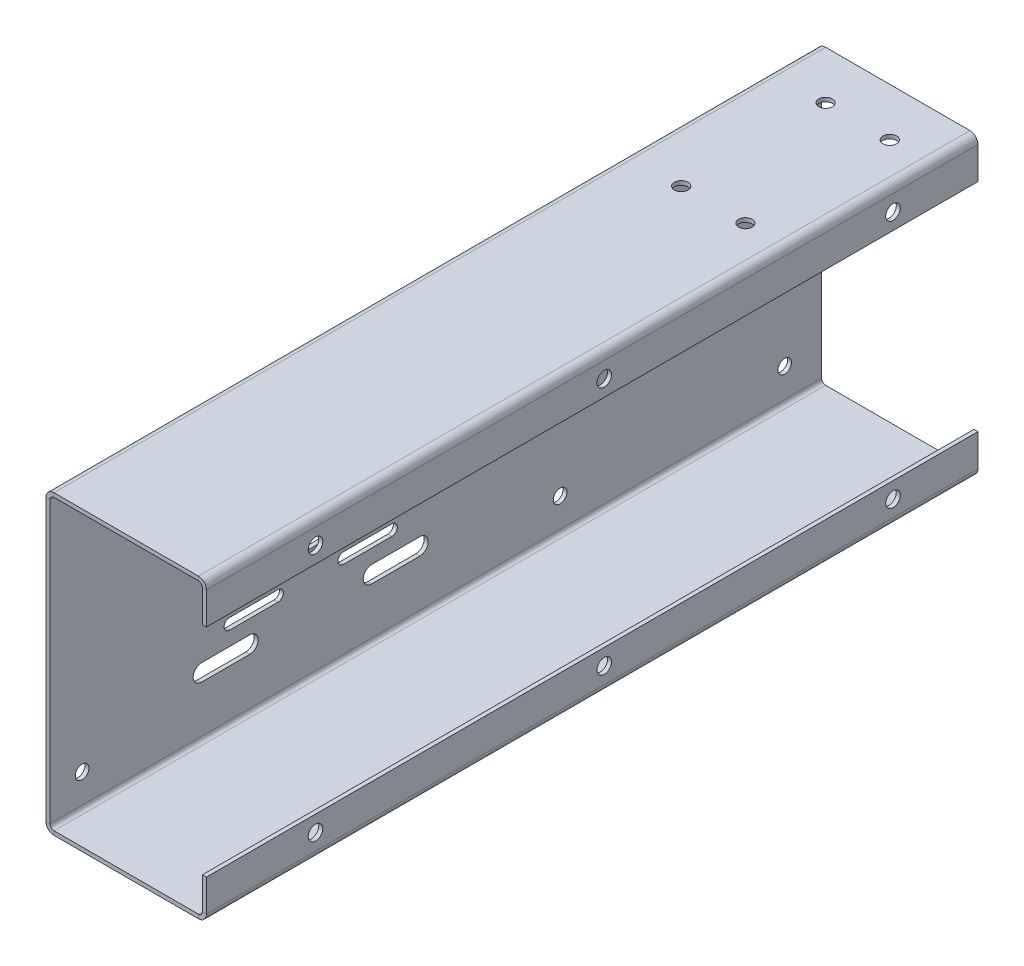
ISO-10303-21;
HEADER;
FILE_DESCRIPTION(('STEP AP214'),'2;1');
FILE_NAME('part.step','',(''),(''),'','','');
FILE_SCHEMA(('AUTOMOTIVE_DESIGN { 1 0 10303 214 1 1 1 1 }'));
ENDSEC;
DATA;
#1=APPLICATION_CONTEXT('core data for automotive mechanical design processes');
#2=APPLICATION_PROTOCOL_DEFINITION('international standard','automotive_design',2000,#1);
#3=PRODUCT_CONTEXT('',#1,'mechanical');
#4=PRODUCT('Part','Part','',(#3));
#5=PRODUCT_RELATED_PRODUCT_CATEGORY('part','',(#4));
#6=PRODUCT_DEFINITION_FORMATION('','',#4);
#7=PRODUCT_DEFINITION_CONTEXT('part definition',#1,'design');
#8=PRODUCT_DEFINITION('design','',#6,#7);
#9=PRODUCT_DEFINITION_SHAPE('','',#8);
#10=(LENGTH_UNIT() NAMED_UNIT(*) SI_UNIT(.MILLI.,.METRE.));
#11=(NAMED_UNIT(*) PLANE_ANGLE_UNIT() SI_UNIT($,.RADIAN.));
#12=(NAMED_UNIT(*) SI_UNIT($,.STERADIAN.) SOLID_ANGLE_UNIT());
#13=UNCERTAINTY_MEASURE_WITH_UNIT(LENGTH_MEASURE(1.E-05),#10,'distance_accuracy_value','');
#14=(GEOMETRIC_REPRESENTATION_CONTEXT(3) GLOBAL_UNCERTAINTY_ASSIGNED_CONTEXT((#13)) GLOBAL_UNIT_ASSIGNED_CONTEXT((#10,
#11,#12)) REPRESENTATION_CONTEXT('',''));
#15=CARTESIAN_POINT('',(0.,0.,0.));
#16=DIRECTION('',(0.,0.,1.));
#17=DIRECTION('',(1.,0.,0.));
#18=AXIS2_PLACEMENT_3D('',#15,#16,#17);
#19=CARTESIAN_POINT('',(95.,0.,481.));
#20=DIRECTION('',(0.,0.,1.));
#21=DIRECTION('',(1.,0.,0.));
#22=AXIS2_PLACEMENT_3D('',#19,#20,#21);
#23=PLANE('',#22);
#24=DIRECTION('',(0.,1.,0.));
#25=VECTOR('',#24,1.);
#26=CARTESIAN_POINT('',(95.,0.,481.));
#27=LINE('',#26,#25);
#28=CARTESIAN_POINT('',(95.,0.,481.));
#29=VERTEX_POINT('',#28);
#30=CARTESIAN_POINT('',(95.,2.50000000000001,481.));
#31=VERTEX_POINT('',#30);
#32=EDGE_CURVE('E11',#29,#31,#27,.T.);
#33=ORIENTED_EDGE('',*,*,#32,.F.);
#34=CARTESIAN_POINT('',(95.,5.00000000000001,481.));
#35=DIRECTION('',(0.,0.,1.));
#36=DIRECTION('',(1.,0.,0.));
#37=AXIS2_PLACEMENT_3D('',#34,#35,#36);
#38=CIRCLE('',#37,5.);
#39=CARTESIAN_POINT('',(100.,5.00000000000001,481.));
#40=VERTEX_POINT('',#39);
#41=EDGE_CURVE('E983',#40,#29,#38,.F.);
#42=ORIENTED_EDGE('',*,*,#41,.F.);
#43=DIRECTION('',(1.,0.,0.));
#44=VECTOR('',#43,1.);
#45=CARTESIAN_POINT('',(97.5,5.00000000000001,481.));
#46=LINE('',#45,#44);
#47=CARTESIAN_POINT('',(97.5,5.00000000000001,481.));
#48=VERTEX_POINT('',#47);
#49=EDGE_CURVE('E59',#48,#40,#46,.T.);
#50=ORIENTED_EDGE('',*,*,#49,.F.);
#51=CARTESIAN_POINT('',(95.,5.00000000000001,481.));
#52=DIRECTION('',(0.,0.,1.));
#53=DIRECTION('',(1.,0.,0.));
#54=AXIS2_PLACEMENT_3D('',#51,#52,#53);
#55=CIRCLE('',#54,2.5);
#56=EDGE_CURVE('E998',#48,#31,#55,.F.);
#57=ORIENTED_EDGE('',*,*,#56,.T.);
#58=EDGE_LOOP('',(#33,#42,#50,#57));
#59=FACE_BOUND('',#58,.T.);
#60=ADVANCED_FACE('F50',(#59),#23,.T.);
#61=CARTESIAN_POINT('',(97.5,5.00000000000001,481.));
#62=DIRECTION('',(0.,0.,1.));
#63=DIRECTION('',(1.,0.,0.));
#64=AXIS2_PLACEMENT_3D('',#61,#62,#63);
#65=PLANE('',#64);
#66=DIRECTION('',(-1.,0.,0.));
#67=VECTOR('',#66,1.);
#68=CARTESIAN_POINT('',(100.,0.,481.));
#69=LINE('',#68,#67);
#70=CARTESIAN_POINT('',(5.,0.,481.));
#71=VERTEX_POINT('',#70);
#72=EDGE_CURVE('E979',#29,#71,#69,.T.);
#73=ORIENTED_EDGE('',*,*,#72,.F.);
#74=ORIENTED_EDGE('',*,*,#32,.T.);
#75=DIRECTION('',(-1.,0.,0.));
#76=VECTOR('',#75,1.);
#77=CARTESIAN_POINT('',(100.,2.50000000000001,481.));
#78=LINE('',#77,#76);
#79=CARTESIAN_POINT('',(5.,2.5,481.));
#80=VERTEX_POINT('',#79);
#81=EDGE_CURVE('E1002',#31,#80,#78,.T.);
#82=ORIENTED_EDGE('',*,*,#81,.T.);
#83=DIRECTION('',(0.,-1.,0.));
#84=VECTOR('',#83,1.);
#85=CARTESIAN_POINT('',(5.,2.5,481.));
#86=LINE('',#85,#84);
#87=EDGE_CURVE('E1132',#80,#71,#86,.T.);
#88=ORIENTED_EDGE('',*,*,#87,.T.);
#89=EDGE_LOOP('',(#73,#74,#82,#88));
#90=FACE_BOUND('',#89,.T.);
#91=ADVANCED_FACE('F1259',(#90),#65,.T.);
#92=CARTESIAN_POINT('',(100.,5.00000000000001,0.));
#93=DIRECTION('',(0.,0.,-1.));
#94=DIRECTION('',(-1.,0.,0.));
#95=AXIS2_PLACEMENT_3D('',#92,#93,#94);
#96=PLANE('',#95);
#97=DIRECTION('',(-1.,0.,0.));
#98=VECTOR('',#97,1.);
#99=CARTESIAN_POINT('',(100.,5.00000000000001,0.));
#100=LINE('',#99,#98);
#101=CARTESIAN_POINT('',(100.,5.00000000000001,0.));
#102=VERTEX_POINT('',#101);
#103=CARTESIAN_POINT('',(97.5,5.00000000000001,0.));
#104=VERTEX_POINT('',#103);
#105=EDGE_CURVE('E1141',#102,#104,#100,.T.);
#106=ORIENTED_EDGE('',*,*,#105,.F.);
#107=CARTESIAN_POINT('',(95.,5.00000000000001,0.));
#108=DIRECTION('',(0.,0.,1.));
#109=DIRECTION('',(1.,0.,0.));
#110=AXIS2_PLACEMENT_3D('',#107,#108,#109);
#111=CIRCLE('',#110,5.);
#112=CARTESIAN_POINT('',(95.,0.,0.));
#113=VERTEX_POINT('',#112);
#114=EDGE_CURVE('E904',#102,#113,#111,.F.);
#115=ORIENTED_EDGE('',*,*,#114,.T.);
#116=DIRECTION('',(0.,-1.,0.));
#117=VECTOR('',#116,1.);
#118=CARTESIAN_POINT('',(95.,2.50000000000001,0.));
#119=LINE('',#118,#117);
#120=CARTESIAN_POINT('',(95.,2.50000000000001,0.));
#121=VERTEX_POINT('',#120);
#122=EDGE_CURVE('E1138',#121,#113,#119,.T.);
#123=ORIENTED_EDGE('',*,*,#122,.F.);
#124=CARTESIAN_POINT('',(95.,5.00000000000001,0.));
#125=DIRECTION('',(0.,0.,1.));
#126=DIRECTION('',(1.,0.,0.));
#127=AXIS2_PLACEMENT_3D('',#124,#125,#126);
#128=CIRCLE('',#127,2.5);
#129=EDGE_CURVE('E920',#104,#121,#128,.F.);
#130=ORIENTED_EDGE('',*,*,#129,.F.);
#131=EDGE_LOOP('',(#106,#115,#123,#130));
#132=FACE_BOUND('',#131,.T.);
#133=ADVANCED_FACE('F1229',(#132),#96,.T.);
#134=CARTESIAN_POINT('',(95.,2.50000000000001,0.));
#135=DIRECTION('',(0.,0.,-1.));
#136=DIRECTION('',(-1.,0.,0.));
#137=AXIS2_PLACEMENT_3D('',#134,#135,#136);
#138=PLANE('',#137);
#139=DIRECTION('',(0.,-1.,0.));
#140=VECTOR('',#139,1.);
#141=CARTESIAN_POINT('',(100.,25.,0.));
#142=LINE('',#141,#140);
#143=CARTESIAN_POINT('',(100.,25.,0.));
#144=VERTEX_POINT('',#143);
#145=EDGE_CURVE('E908',#144,#102,#142,.T.);
#146=ORIENTED_EDGE('',*,*,#145,.T.);
#147=ORIENTED_EDGE('',*,*,#105,.T.);
#148=DIRECTION('',(0.,1.,0.));
#149=VECTOR('',#148,1.);
#150=CARTESIAN_POINT('',(97.5,25.,0.));
#151=LINE('',#150,#149);
#152=CARTESIAN_POINT('',(97.5,25.,0.));
#153=VERTEX_POINT('',#152);
#154=EDGE_CURVE('E916',#153,#104,#151,.F.);
#155=ORIENTED_EDGE('',*,*,#154,.F.);
#156=DIRECTION('',(1.,0.,0.));
#157=VECTOR('',#156,1.);
#158=CARTESIAN_POINT('',(97.5,25.,0.));
#159=LINE('',#158,#157);
#160=EDGE_CURVE('E912',#153,#144,#159,.T.);
#161=ORIENTED_EDGE('',*,*,#160,.T.);
#162=EDGE_LOOP('',(#146,#147,#155,#161));
#163=FACE_BOUND('',#162,.T.);
#164=ADVANCED_FACE('F1237',(#163),#138,.T.);
#165=CARTESIAN_POINT('',(0.,5.,481.));
#166=DIRECTION('',(0.,0.,1.));
#167=DIRECTION('',(1.,0.,0.));
#168=AXIS2_PLACEMENT_3D('',#165,#166,#167);
#169=PLANE('',#168);
#170=DIRECTION('',(1.,0.,0.));
#171=VECTOR('',#170,1.);
#172=CARTESIAN_POINT('',(0.,5.,481.));
#173=LINE('',#172,#171);
#174=CARTESIAN_POINT('',(0.,5.,481.));
#175=VERTEX_POINT('',#174);
#176=CARTESIAN_POINT('',(2.5,5.,481.));
#177=VERTEX_POINT('',#176);
#178=EDGE_CURVE('E1135',#175,#177,#173,.T.);
#179=ORIENTED_EDGE('',*,*,#178,.F.);
#180=CARTESIAN_POINT('',(5.,5.,481.));
#181=DIRECTION('',(0.,0.,1.));
#182=DIRECTION('',(1.,0.,0.));
#183=AXIS2_PLACEMENT_3D('',#180,#181,#182);
#184=CIRCLE('',#183,5.);
#185=EDGE_CURVE('E975',#71,#175,#184,.F.);
#186=ORIENTED_EDGE('',*,*,#185,.F.);
#187=ORIENTED_EDGE('',*,*,#87,.F.);
#188=CARTESIAN_POINT('',(5.,5.,481.));
#189=DIRECTION('',(0.,0.,1.));
#190=DIRECTION('',(1.,0.,0.));
#191=AXIS2_PLACEMENT_3D('',#188,#189,#190);
#192=CIRCLE('',#191,2.5);
#193=EDGE_CURVE('E1006',#80,#177,#192,.F.);
#194=ORIENTED_EDGE('',*,*,#193,.T.);
#195=EDGE_LOOP('',(#179,#186,#187,#194));
#196=FACE_BOUND('',#195,.T.);
#197=ADVANCED_FACE('F1262',(#196),#169,.T.);
#198=CARTESIAN_POINT('',(5.,2.5,481.));
#199=DIRECTION('',(0.,0.,1.));
#200=DIRECTION('',(1.,0.,0.));
#201=AXIS2_PLACEMENT_3D('',#198,#199,#200);
#202=PLANE('',#201);
#203=DIRECTION('',(0.,1.,0.));
#204=VECTOR('',#203,1.);
#205=CARTESIAN_POINT('',(0.,0.,481.));
#206=LINE('',#205,#204);
#207=CARTESIAN_POINT('',(0.,180.,481.));
#208=VERTEX_POINT('',#207);
#209=EDGE_CURVE('E971',#175,#208,#206,.T.);
#210=ORIENTED_EDGE('',*,*,#209,.F.);
#211=ORIENTED_EDGE('',*,*,#178,.T.);
#212=DIRECTION('',(0.,1.,0.));
#213=VECTOR('',#212,1.);
#214=CARTESIAN_POINT('',(2.5,0.,481.));
#215=LINE('',#214,#213);
#216=CARTESIAN_POINT('',(2.5,180.,481.));
#217=VERTEX_POINT('',#216);
#218=EDGE_CURVE('E1010',#177,#217,#215,.T.);
#219=ORIENTED_EDGE('',*,*,#218,.T.);
#220=DIRECTION('',(-1.,0.,0.));
#221=VECTOR('',#220,1.);
#222=CARTESIAN_POINT('',(2.5,180.,481.));
#223=LINE('',#222,#221);
#224=EDGE_CURVE('E1120',#217,#208,#223,.T.);
#225=ORIENTED_EDGE('',*,*,#224,.T.);
#226=EDGE_LOOP('',(#210,#211,#219,#225));
#227=FACE_BOUND('',#226,.T.);
#228=ADVANCED_FACE('F1266',(#227),#202,.T.);
#229=CARTESIAN_POINT('',(5.,0.,0.));
#230=DIRECTION('',(0.,0.,-1.));
#231=DIRECTION('',(-1.,0.,0.));
#232=AXIS2_PLACEMENT_3D('',#229,#230,#231);
#233=PLANE('',#232);
#234=DIRECTION('',(0.,1.,0.));
#235=VECTOR('',#234,1.);
#236=CARTESIAN_POINT('',(5.,0.,0.));
#237=LINE('',#236,#235);
#238=CARTESIAN_POINT('',(5.,0.,0.));
#239=VERTEX_POINT('',#238);
#240=CARTESIAN_POINT('',(5.,2.5,0.));
#241=VERTEX_POINT('',#240);
#242=EDGE_CURVE('E1129',#239,#241,#237,.T.);
#243=ORIENTED_EDGE('',*,*,#242,.F.);
#244=CARTESIAN_POINT('',(5.,5.,0.));
#245=DIRECTION('',(0.,0.,1.));
#246=DIRECTION('',(1.,0.,0.));
#247=AXIS2_PLACEMENT_3D('',#244,#245,#246);
#248=CIRCLE('',#247,5.);
#249=CARTESIAN_POINT('',(0.,5.,0.));
#250=VERTEX_POINT('',#249);
#251=EDGE_CURVE('E896',#239,#250,#248,.F.);
#252=ORIENTED_EDGE('',*,*,#251,.T.);
#253=DIRECTION('',(-1.,0.,0.));
#254=VECTOR('',#253,1.);
#255=CARTESIAN_POINT('',(2.5,5.,0.));
#256=LINE('',#255,#254);
#257=CARTESIAN_POINT('',(2.5,5.,0.));
#258=VERTEX_POINT('',#257);
#259=EDGE_CURVE('E1126',#258,#250,#256,.T.);
#260=ORIENTED_EDGE('',*,*,#259,.F.);
#261=CARTESIAN_POINT('',(5.,5.,0.));
#262=DIRECTION('',(0.,0.,1.));
#263=DIRECTION('',(1.,0.,0.));
#264=AXIS2_PLACEMENT_3D('',#261,#262,#263);
#265=CIRCLE('',#264,2.5);
#266=EDGE_CURVE('E928',#241,#258,#265,.F.);
#267=ORIENTED_EDGE('',*,*,#266,.F.);
#268=EDGE_LOOP('',(#243,#252,#260,#267));
#269=FACE_BOUND('',#268,.T.);
#270=ADVANCED_FACE('F1213',(#269),#233,.T.);
#271=CARTESIAN_POINT('',(2.5,5.,0.));
#272=DIRECTION('',(0.,0.,-1.));
#273=DIRECTION('',(-1.,0.,0.));
#274=AXIS2_PLACEMENT_3D('',#271,#272,#273);
#275=PLANE('',#274);
#276=DIRECTION('',(-1.,0.,0.));
#277=VECTOR('',#276,1.);
#278=CARTESIAN_POINT('',(100.,0.,0.));
#279=LINE('',#278,#277);
#280=EDGE_CURVE('E900',#113,#239,#279,.T.);
#281=ORIENTED_EDGE('',*,*,#280,.T.);
#282=ORIENTED_EDGE('',*,*,#242,.T.);
#283=DIRECTION('',(-1.,0.,0.));
#284=VECTOR('',#283,1.);
#285=CARTESIAN_POINT('',(100.,2.50000000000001,0.));
#286=LINE('',#285,#284);
#287=EDGE_CURVE('E924',#121,#241,#286,.T.);
#288=ORIENTED_EDGE('',*,*,#287,.F.);
#289=ORIENTED_EDGE('',*,*,#122,.T.);
#290=EDGE_LOOP('',(#281,#282,#288,#289));
#291=FACE_BOUND('',#290,.T.);
#292=ADVANCED_FACE('F1221',(#291),#275,.T.);
#293=CARTESIAN_POINT('',(5.,185.,481.));
#294=DIRECTION('',(0.,0.,1.));
#295=DIRECTION('',(1.,0.,0.));
#296=AXIS2_PLACEMENT_3D('',#293,#294,#295);
#297=PLANE('',#296);
#298=DIRECTION('',(0.,-1.,0.));
#299=VECTOR('',#298,1.);
#300=CARTESIAN_POINT('',(5.,185.,481.));
#301=LINE('',#300,#299);
#302=CARTESIAN_POINT('',(5.,185.,481.));
#303=VERTEX_POINT('',#302);
#304=CARTESIAN_POINT('',(5.,182.5,481.));
#305=VERTEX_POINT('',#304);
#306=EDGE_CURVE('E1123',#303,#305,#301,.T.);
#307=ORIENTED_EDGE('',*,*,#306,.F.);
#308=CARTESIAN_POINT('',(5.,180.,481.));
#309=DIRECTION('',(0.,0.,1.));
#310=DIRECTION('',(1.,0.,0.));
#311=AXIS2_PLACEMENT_3D('',#308,#309,#310);
#312=CIRCLE('',#311,5.);
#313=EDGE_CURVE('E967',#208,#303,#312,.F.);
#314=ORIENTED_EDGE('',*,*,#313,.F.);
#315=ORIENTED_EDGE('',*,*,#224,.F.);
#316=CARTESIAN_POINT('',(5.,180.,481.));
#317=DIRECTION('',(0.,0.,1.));
#318=DIRECTION('',(1.,0.,0.));
#319=AXIS2_PLACEMENT_3D('',#316,#317,#318);
#320=CIRCLE('',#319,2.5);
#321=EDGE_CURVE('E1014',#217,#305,#320,.F.);
#322=ORIENTED_EDGE('',*,*,#321,.T.);
#323=EDGE_LOOP('',(#307,#314,#315,#322));
#324=FACE_BOUND('',#323,.T.);
#325=ADVANCED_FACE('F1270',(#324),#297,.T.);
#326=CARTESIAN_POINT('',(2.5,180.,481.));
#327=DIRECTION('',(0.,0.,1.));
#328=DIRECTION('',(1.,0.,0.));
#329=AXIS2_PLACEMENT_3D('',#326,#327,#328);
#330=PLANE('',#329);
#331=DIRECTION('',(1.,0.,0.));
#332=VECTOR('',#331,1.);
#333=CARTESIAN_POINT('',(0.,185.,481.));
#334=LINE('',#333,#332);
#335=CARTESIAN_POINT('',(95.,185.,481.));
#336=VERTEX_POINT('',#335);
#337=EDGE_CURVE('E963',#303,#336,#334,.T.);
#338=ORIENTED_EDGE('',*,*,#337,.F.);
#339=ORIENTED_EDGE('',*,*,#306,.T.);
#340=DIRECTION('',(1.,0.,0.));
#341=VECTOR('',#340,1.);
#342=CARTESIAN_POINT('',(0.,182.5,481.));
#343=LINE('',#342,#341);
#344=CARTESIAN_POINT('',(95.,182.5,481.));
#345=VERTEX_POINT('',#344);
#346=EDGE_CURVE('E1018',#305,#345,#343,.T.);
#347=ORIENTED_EDGE('',*,*,#346,.T.);
#348=DIRECTION('',(0.,1.,0.));
#349=VECTOR('',#348,1.);
#350=CARTESIAN_POINT('',(95.,182.5,481.));
#351=LINE('',#350,#349);
#352=EDGE_CURVE('E1108',#345,#336,#351,.T.);
#353=ORIENTED_EDGE('',*,*,#352,.T.);
#354=EDGE_LOOP('',(#338,#339,#347,#353));
#355=FACE_BOUND('',#354,.T.);
#356=ADVANCED_FACE('F1274',(#355),#330,.T.);
#357=CARTESIAN_POINT('',(0.,180.,0.));
#358=DIRECTION('',(0.,0.,-1.));
#359=DIRECTION('',(-1.,0.,0.));
#360=AXIS2_PLACEMENT_3D('',#357,#358,#359);
#361=PLANE('',#360);
#362=DIRECTION('',(1.,0.,0.));
#363=VECTOR('',#362,1.);
#364=CARTESIAN_POINT('',(0.,180.,0.));
#365=LINE('',#364,#363);
#366=CARTESIAN_POINT('',(0.,180.,0.));
#367=VERTEX_POINT('',#366);
#368=CARTESIAN_POINT('',(2.5,180.,0.));
#369=VERTEX_POINT('',#368);
#370=EDGE_CURVE('E1117',#367,#369,#365,.T.);
#371=ORIENTED_EDGE('',*,*,#370,.F.);
#372=CARTESIAN_POINT('',(5.,180.,0.));
#373=DIRECTION('',(0.,0.,1.));
#374=DIRECTION('',(1.,0.,0.));
#375=AXIS2_PLACEMENT_3D('',#372,#373,#374);
#376=CIRCLE('',#375,5.);
#377=CARTESIAN_POINT('',(5.,185.,0.));
#378=VERTEX_POINT('',#377);
#379=EDGE_CURVE('E888',#367,#378,#376,.F.);
#380=ORIENTED_EDGE('',*,*,#379,.T.);
#381=DIRECTION('',(0.,1.,0.));
#382=VECTOR('',#381,1.);
#383=CARTESIAN_POINT('',(5.,182.5,0.));
#384=LINE('',#383,#382);
#385=CARTESIAN_POINT('',(5.,182.5,0.));
#386=VERTEX_POINT('',#385);
#387=EDGE_CURVE('E1114',#386,#378,#384,.T.);
#388=ORIENTED_EDGE('',*,*,#387,.F.);
#389=CARTESIAN_POINT('',(5.,180.,0.));
#390=DIRECTION('',(0.,0.,1.));
#391=DIRECTION('',(1.,0.,0.));
#392=AXIS2_PLACEMENT_3D('',#389,#390,#391);
#393=CIRCLE('',#392,2.5);
#394=EDGE_CURVE('E936',#369,#386,#393,.F.);
#395=ORIENTED_EDGE('',*,*,#394,.F.);
#396=EDGE_LOOP('',(#371,#380,#388,#395));
#397=FACE_BOUND('',#396,.T.);
#398=ADVANCED_FACE('F1198',(#397),#361,.T.);
#399=CARTESIAN_POINT('',(5.,182.5,0.));
#400=DIRECTION('',(0.,0.,-1.));
#401=DIRECTION('',(-1.,0.,0.));
#402=AXIS2_PLACEMENT_3D('',#399,#400,#401);
#403=PLANE('',#402);
#404=DIRECTION('',(0.,1.,0.));
#405=VECTOR('',#404,1.);
#406=CARTESIAN_POINT('',(0.,0.,0.));
#407=LINE('',#406,#405);
#408=EDGE_CURVE('E892',#250,#367,#407,.T.);
#409=ORIENTED_EDGE('',*,*,#408,.T.);
#410=ORIENTED_EDGE('',*,*,#370,.T.);
#411=DIRECTION('',(0.,1.,0.));
#412=VECTOR('',#411,1.);
#413=CARTESIAN_POINT('',(2.5,0.,0.));
#414=LINE('',#413,#412);
#415=EDGE_CURVE('E932',#258,#369,#414,.T.);
#416=ORIENTED_EDGE('',*,*,#415,.F.);
#417=ORIENTED_EDGE('',*,*,#259,.T.);
#418=EDGE_LOOP('',(#409,#410,#416,#417));
#419=FACE_BOUND('',#418,.T.);
#420=ADVANCED_FACE('F1205',(#419),#403,.T.);
#421=CARTESIAN_POINT('',(100.,180.,481.));
#422=DIRECTION('',(0.,0.,1.));
#423=DIRECTION('',(1.,0.,0.));
#424=AXIS2_PLACEMENT_3D('',#421,#422,#423);
#425=PLANE('',#424);
#426=DIRECTION('',(-1.,0.,0.));
#427=VECTOR('',#426,1.);
#428=CARTESIAN_POINT('',(100.,180.,481.));
#429=LINE('',#428,#427);
#430=CARTESIAN_POINT('',(100.,180.,481.));
#431=VERTEX_POINT('',#430);
#432=CARTESIAN_POINT('',(97.5,180.,481.));
#433=VERTEX_POINT('',#432);
#434=EDGE_CURVE('E1111',#431,#433,#429,.T.);
#435=ORIENTED_EDGE('',*,*,#434,.F.);
#436=CARTESIAN_POINT('',(95.,180.,481.));
#437=DIRECTION('',(0.,0.,1.));
#438=DIRECTION('',(1.,0.,0.));
#439=AXIS2_PLACEMENT_3D('',#436,#437,#438);
#440=CIRCLE('',#439,5.);
#441=EDGE_CURVE('E959',#336,#431,#440,.F.);
#442=ORIENTED_EDGE('',*,*,#441,.F.);
#443=ORIENTED_EDGE('',*,*,#352,.F.);
#444=CARTESIAN_POINT('',(95.,180.,481.));
#445=DIRECTION('',(0.,0.,1.));
#446=DIRECTION('',(1.,0.,0.));
#447=AXIS2_PLACEMENT_3D('',#444,#445,#446);
#448=CIRCLE('',#447,2.5);
#449=EDGE_CURVE('E1022',#345,#433,#448,.F.);
#450=ORIENTED_EDGE('',*,*,#449,.T.);
#451=EDGE_LOOP('',(#435,#442,#443,#450));
#452=FACE_BOUND('',#451,.T.);
#453=ADVANCED_FACE('F1280',(#452),#425,.T.);
#454=CARTESIAN_POINT('',(95.,182.5,481.));
#455=DIRECTION('',(0.,0.,1.));
#456=DIRECTION('',(1.,0.,0.));
#457=AXIS2_PLACEMENT_3D('',#454,#455,#456);
#458=PLANE('',#457);
#459=DIRECTION('',(0.,-1.,0.));
#460=VECTOR('',#459,1.);
#461=CARTESIAN_POINT('',(100.,185.,481.));
#462=LINE('',#461,#460);
#463=CARTESIAN_POINT('',(100.,160.,481.));
#464=VERTEX_POINT('',#463);
#465=EDGE_CURVE('E955',#431,#464,#462,.T.);
#466=ORIENTED_EDGE('',*,*,#465,.F.);
#467=ORIENTED_EDGE('',*,*,#434,.T.);
#468=DIRECTION('',(0.,1.,0.));
#469=VECTOR('',#468,1.);
#470=CARTESIAN_POINT('',(97.5,185.,481.));
#471=LINE('',#470,#469);
#472=CARTESIAN_POINT('',(97.5,160.,481.));
#473=VERTEX_POINT('',#472);
#474=EDGE_CURVE('E948',#433,#473,#471,.F.);
#475=ORIENTED_EDGE('',*,*,#474,.T.);
#476=DIRECTION('',(-1.,0.,0.));
#477=VECTOR('',#476,1.);
#478=CARTESIAN_POINT('',(100.,160.,481.));
#479=LINE('',#478,#477);
#480=EDGE_CURVE('E951',#464,#473,#479,.T.);
#481=ORIENTED_EDGE('',*,*,#480,.F.);
#482=EDGE_LOOP('',(#466,#467,#475,#481));
#483=FACE_BOUND('',#482,.T.);
#484=ADVANCED_FACE('F1290',(#483),#458,.T.);
#485=CARTESIAN_POINT('',(95.,185.,0.));
#486=DIRECTION('',(0.,0.,-1.));
#487=DIRECTION('',(-1.,0.,0.));
#488=AXIS2_PLACEMENT_3D('',#485,#486,#487);
#489=PLANE('',#488);
#490=DIRECTION('',(0.,-1.,0.));
#491=VECTOR('',#490,1.);
#492=CARTESIAN_POINT('',(95.,185.,0.));
#493=LINE('',#492,#491);
#494=CARTESIAN_POINT('',(95.,185.,0.));
#495=VERTEX_POINT('',#494);
#496=CARTESIAN_POINT('',(95.,182.5,0.));
#497=VERTEX_POINT('',#496);
#498=EDGE_CURVE('E1105',#495,#497,#493,.T.);
#499=ORIENTED_EDGE('',*,*,#498,.F.);
#500=CARTESIAN_POINT('',(95.,180.,0.));
#501=DIRECTION('',(0.,0.,1.));
#502=DIRECTION('',(1.,0.,0.));
#503=AXIS2_PLACEMENT_3D('',#500,#501,#502);
#504=CIRCLE('',#503,5.);
#505=CARTESIAN_POINT('',(100.,180.,0.));
#506=VERTEX_POINT('',#505);
#507=EDGE_CURVE('E880',#495,#506,#504,.F.);
#508=ORIENTED_EDGE('',*,*,#507,.T.);
#509=DIRECTION('',(1.,0.,0.));
#510=VECTOR('',#509,1.);
#511=CARTESIAN_POINT('',(97.5,180.,0.));
#512=LINE('',#511,#510);
#513=CARTESIAN_POINT('',(97.5,180.,0.));
#514=VERTEX_POINT('',#513);
#515=EDGE_CURVE('E1102',#514,#506,#512,.T.);
#516=ORIENTED_EDGE('',*,*,#515,.F.);
#517=CARTESIAN_POINT('',(95.,180.,0.));
#518=DIRECTION('',(0.,0.,1.));
#519=DIRECTION('',(1.,0.,0.));
#520=AXIS2_PLACEMENT_3D('',#517,#518,#519);
#521=CIRCLE('',#520,2.5);
#522=EDGE_CURVE('E944',#497,#514,#521,.F.);
#523=ORIENTED_EDGE('',*,*,#522,.F.);
#524=EDGE_LOOP('',(#499,#508,#516,#523));
#525=FACE_BOUND('',#524,.T.);
#526=ADVANCED_FACE('F1301',(#525),#489,.T.);
#527=CARTESIAN_POINT('',(97.5,180.,0.));
#528=DIRECTION('',(0.,0.,-1.));
#529=DIRECTION('',(-1.,0.,0.));
#530=AXIS2_PLACEMENT_3D('',#527,#528,#529);
#531=PLANE('',#530);
#532=DIRECTION('',(1.,0.,0.));
#533=VECTOR('',#532,1.);
#534=CARTESIAN_POINT('',(0.,185.,0.));
#535=LINE('',#534,#533);
#536=EDGE_CURVE('E884',#378,#495,#535,.T.);
#537=ORIENTED_EDGE('',*,*,#536,.T.);
#538=ORIENTED_EDGE('',*,*,#498,.T.);
#539=DIRECTION('',(1.,0.,0.));
#540=VECTOR('',#539,1.);
#541=CARTESIAN_POINT('',(0.,182.5,0.));
#542=LINE('',#541,#540);
#543=EDGE_CURVE('E940',#386,#497,#542,.T.);
#544=ORIENTED_EDGE('',*,*,#543,.F.);
#545=ORIENTED_EDGE('',*,*,#387,.T.);
#546=EDGE_LOOP('',(#537,#538,#544,#545));
#547=FACE_BOUND('',#546,.T.);
#548=ADVANCED_FACE('F1307',(#547),#531,.T.);
#549=CARTESIAN_POINT('',(97.5,185.,481.));
#550=DIRECTION('',(1.,0.,0.));
#551=DIRECTION('',(0.,0.,-1.));
#552=AXIS2_PLACEMENT_3D('',#549,#550,#551);
#553=PLANE('',#552);
#554=CARTESIAN_POINT('',(97.5,170.,413.));
#555=DIRECTION('',(1.,0.,0.));
#556=DIRECTION('',(0.,0.,-1.));
#557=AXIS2_PLACEMENT_3D('',#554,#555,#556);
#558=CIRCLE('',#557,4.55);
#559=CARTESIAN_POINT('',(97.5,170.,408.45));
#560=VERTEX_POINT('',#559);
#561=EDGE_CURVE('E848',#560,#560,#558,.T.);
#562=ORIENTED_EDGE('',*,*,#561,.T.);
#563=EDGE_LOOP('',(#562));
#564=FACE_BOUND('',#563,.T.);
#565=CARTESIAN_POINT('',(97.5,170.,233.));
#566=DIRECTION('',(1.,0.,0.));
#567=DIRECTION('',(0.,0.,-1.));
#568=AXIS2_PLACEMENT_3D('',#565,#566,#567);
#569=CIRCLE('',#568,4.55);
#570=CARTESIAN_POINT('',(97.5,170.,228.45));
#571=VERTEX_POINT('',#570);
#572=EDGE_CURVE('E856',#571,#571,#569,.T.);
#573=ORIENTED_EDGE('',*,*,#572,.T.);
#574=EDGE_LOOP('',(#573));
#575=FACE_BOUND('',#574,.T.);
#576=CARTESIAN_POINT('',(97.5,170.,53.));
#577=DIRECTION('',(1.,0.,0.));
#578=DIRECTION('',(0.,0.,-1.));
#579=AXIS2_PLACEMENT_3D('',#576,#577,#578);
#580=CIRCLE('',#579,4.55);
#581=CARTESIAN_POINT('',(97.5,170.,48.45));
#582=VERTEX_POINT('',#581);
#583=EDGE_CURVE('E864',#582,#582,#580,.T.);
#584=ORIENTED_EDGE('',*,*,#583,.T.);
#585=EDGE_LOOP('',(#584));
#586=FACE_BOUND('',#585,.T.);
#587=DIRECTION('',(0.,1.,0.));
#588=VECTOR('',#587,1.);
#589=CARTESIAN_POINT('',(97.5,185.,0.));
#590=LINE('',#589,#588);
#591=CARTESIAN_POINT('',(97.5,160.,0.));
#592=VERTEX_POINT('',#591);
#593=EDGE_CURVE('E868',#514,#592,#590,.F.);
#594=ORIENTED_EDGE('',*,*,#593,.T.);
#595=DIRECTION('',(0.,0.,-1.));
#596=VECTOR('',#595,1.);
#597=CARTESIAN_POINT('',(97.5,160.,481.));
#598=LINE('',#597,#596);
#599=EDGE_CURVE('E1099',#473,#592,#598,.T.);
#600=ORIENTED_EDGE('',*,*,#599,.F.);
#601=ORIENTED_EDGE('',*,*,#474,.F.);
#602=DIRECTION('',(0.,0.,-1.));
#603=VECTOR('',#602,1.);
#604=CARTESIAN_POINT('',(97.5,180.,481.));
#605=LINE('',#604,#603);
#606=EDGE_CURVE('E1026',#433,#514,#605,.T.);
#607=ORIENTED_EDGE('',*,*,#606,.T.);
#608=EDGE_LOOP('',(#594,#600,#601,#607));
#609=FACE_BOUND('',#608,.T.);
#610=ADVANCED_FACE('F1305',(#564,#575,#586,#609),#553,.F.);
#611=CARTESIAN_POINT('',(100.,160.,481.));
#612=DIRECTION('',(0.,-1.,0.));
#613=DIRECTION('',(0.,0.,-1.));
#614=AXIS2_PLACEMENT_3D('',#611,#612,#613);
#615=PLANE('',#614);
#616=DIRECTION('',(-1.,0.,0.));
#617=VECTOR('',#616,1.);
#618=CARTESIAN_POINT('',(100.,160.,0.));
#619=LINE('',#618,#617);
#620=CARTESIAN_POINT('',(100.,160.,0.));
#621=VERTEX_POINT('',#620);
#622=EDGE_CURVE('E872',#621,#592,#619,.T.);
#623=ORIENTED_EDGE('',*,*,#622,.F.);
#624=DIRECTION('',(0.,0.,-1.));
#625=VECTOR('',#624,1.);
#626=CARTESIAN_POINT('',(100.,160.,481.));
#627=LINE('',#626,#625);
#628=EDGE_CURVE('E1096',#464,#621,#627,.T.);
#629=ORIENTED_EDGE('',*,*,#628,.F.);
#630=ORIENTED_EDGE('',*,*,#480,.T.);
#631=ORIENTED_EDGE('',*,*,#599,.T.);
#632=EDGE_LOOP('',(#623,#629,#630,#631));
#633=FACE_BOUND('',#632,.T.);
#634=ADVANCED_FACE('F1295',(#633),#615,.T.);
#635=CARTESIAN_POINT('',(100.,185.,481.));
#636=DIRECTION('',(1.,0.,0.));
#637=DIRECTION('',(0.,0.,-1.));
#638=AXIS2_PLACEMENT_3D('',#635,#636,#637);
#639=PLANE('',#638);
#640=CARTESIAN_POINT('',(100.,170.,413.));
#641=DIRECTION('',(1.,0.,0.));
#642=DIRECTION('',(0.,0.,-1.));
#643=AXIS2_PLACEMENT_3D('',#640,#641,#642);
#644=CIRCLE('',#643,4.55);
#645=CARTESIAN_POINT('',(100.,170.,408.45));
#646=VERTEX_POINT('',#645);
#647=EDGE_CURVE('E844',#646,#646,#644,.T.);
#648=ORIENTED_EDGE('',*,*,#647,.F.);
#649=EDGE_LOOP('',(#648));
#650=FACE_BOUND('',#649,.T.);
#651=CARTESIAN_POINT('',(100.,170.,233.));
#652=DIRECTION('',(1.,0.,0.));
#653=DIRECTION('',(0.,0.,-1.));
#654=AXIS2_PLACEMENT_3D('',#651,#652,#653);
#655=CIRCLE('',#654,4.55);
#656=CARTESIAN_POINT('',(100.,170.,228.45));
#657=VERTEX_POINT('',#656);
#658=EDGE_CURVE('E852',#657,#657,#655,.T.);
#659=ORIENTED_EDGE('',*,*,#658,.F.);
#660=EDGE_LOOP('',(#659));
#661=FACE_BOUND('',#660,.T.);
#662=CARTESIAN_POINT('',(100.,170.,53.));
#663=DIRECTION('',(1.,0.,0.));
#664=DIRECTION('',(0.,0.,-1.));
#665=AXIS2_PLACEMENT_3D('',#662,#663,#664);
#666=CIRCLE('',#665,4.55);
#667=CARTESIAN_POINT('',(100.,170.,48.45));
#668=VERTEX_POINT('',#667);
#669=EDGE_CURVE('E860',#668,#668,#666,.T.);
#670=ORIENTED_EDGE('',*,*,#669,.F.);
#671=EDGE_LOOP('',(#670));
#672=FACE_BOUND('',#671,.T.);
#673=DIRECTION('',(0.,-1.,0.));
#674=VECTOR('',#673,1.);
#675=CARTESIAN_POINT('',(100.,185.,0.));
#676=LINE('',#675,#674);
#677=EDGE_CURVE('E876',#506,#621,#676,.T.);
#678=ORIENTED_EDGE('',*,*,#677,.F.);
#679=DIRECTION('',(0.,0.,-1.));
#680=VECTOR('',#679,1.);
#681=CARTESIAN_POINT('',(100.,180.,481.));
#682=LINE('',#681,#680);
#683=EDGE_CURVE('E1092',#431,#506,#682,.T.);
#684=ORIENTED_EDGE('',*,*,#683,.F.);
#685=ORIENTED_EDGE('',*,*,#465,.T.);
#686=ORIENTED_EDGE('',*,*,#628,.T.);
#687=EDGE_LOOP('',(#678,#684,#685,#686));
#688=FACE_BOUND('',#687,.T.);
#689=ADVANCED_FACE('F1288',(#650,#661,#672,#688),#639,.T.);
#690=CARTESIAN_POINT('',(95.,180.,481.));
#691=DIRECTION('',(0.,0.,-1.));
#692=DIRECTION('',(-1.,0.,0.));
#693=AXIS2_PLACEMENT_3D('',#690,#691,#692);
#694=CYLINDRICAL_SURFACE('',#693,5.);
#695=ORIENTED_EDGE('',*,*,#507,.F.);
#696=DIRECTION('',(0.,0.,-1.));
#697=VECTOR('',#696,1.);
#698=CARTESIAN_POINT('',(95.,185.,481.));
#699=LINE('',#698,#697);
#700=EDGE_CURVE('E1088',#336,#495,#699,.T.);
#701=ORIENTED_EDGE('',*,*,#700,.F.);
#702=ORIENTED_EDGE('',*,*,#441,.T.);
#703=ORIENTED_EDGE('',*,*,#683,.T.);
#704=EDGE_LOOP('',(#695,#701,#702,#703));
#705=FACE_BOUND('',#704,.T.);
#706=ADVANCED_FACE('F1187',(#705),#694,.T.);
#707=CARTESIAN_POINT('',(0.,185.,481.));
#708=DIRECTION('',(0.,1.,0.));
#709=DIRECTION('',(0.,0.,1.));
#710=AXIS2_PLACEMENT_3D('',#707,#708,#709);
#711=PLANE('',#710);
#712=CARTESIAN_POINT('',(75.,185.,120.));
#713=DIRECTION('',(0.,1.,0.));
#714=DIRECTION('',(0.,0.,1.));
#715=AXIS2_PLACEMENT_3D('',#712,#713,#714);
#716=CIRCLE('',#715,4.24999999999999);
#717=CARTESIAN_POINT('',(75.,185.,124.25));
#718=VERTEX_POINT('',#717);
#719=EDGE_CURVE('E1171',#718,#718,#716,.T.);
#720=ORIENTED_EDGE('',*,*,#719,.F.);
#721=EDGE_LOOP('',(#720));
#722=FACE_BOUND('',#721,.T.);
#723=CARTESIAN_POINT('',(35.,185.,120.));
#724=DIRECTION('',(0.,1.,0.));
#725=DIRECTION('',(0.,0.,1.));
#726=AXIS2_PLACEMENT_3D('',#723,#724,#725);
#727=CIRCLE('',#726,4.24999999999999);
#728=CARTESIAN_POINT('',(35.,185.,124.25));
#729=VERTEX_POINT('',#728);
#730=EDGE_CURVE('E1158',#729,#729,#727,.T.);
#731=ORIENTED_EDGE('',*,*,#730,.F.);
#732=EDGE_LOOP('',(#731));
#733=FACE_BOUND('',#732,.T.);
#734=CARTESIAN_POINT('',(75.,185.,30.));
#735=DIRECTION('',(0.,1.,0.));
#736=DIRECTION('',(0.,0.,1.));
#737=AXIS2_PLACEMENT_3D('',#734,#735,#736);
#738=CIRCLE('',#737,4.24999999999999);
#739=CARTESIAN_POINT('',(75.,185.,34.25));
#740=VERTEX_POINT('',#739);
#741=EDGE_CURVE('E1154',#740,#740,#738,.T.);
#742=ORIENTED_EDGE('',*,*,#741,.F.);
#743=EDGE_LOOP('',(#742));
#744=FACE_BOUND('',#743,.T.);
#745=CARTESIAN_POINT('',(35.,185.,30.));
#746=DIRECTION('',(0.,1.,0.));
#747=DIRECTION('',(0.,0.,1.));
#748=AXIS2_PLACEMENT_3D('',#745,#746,#747);
#749=CIRCLE('',#748,4.24999999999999);
#750=CARTESIAN_POINT('',(35.,185.,34.25));
#751=VERTEX_POINT('',#750);
#752=EDGE_CURVE('E1150',#751,#751,#749,.T.);
#753=ORIENTED_EDGE('',*,*,#752,.F.);
#754=EDGE_LOOP('',(#753));
#755=FACE_BOUND('',#754,.T.);
#756=ORIENTED_EDGE('',*,*,#536,.F.);
#757=DIRECTION('',(0.,0.,-1.));
#758=VECTOR('',#757,1.);
#759=CARTESIAN_POINT('',(5.,185.,481.));
#760=LINE('',#759,#758);
#761=EDGE_CURVE('E1084',#303,#378,#760,.T.);
#762=ORIENTED_EDGE('',*,*,#761,.F.);
#763=ORIENTED_EDGE('',*,*,#337,.T.);
#764=ORIENTED_EDGE('',*,*,#700,.T.);
#765=EDGE_LOOP('',(#756,#762,#763,#764));
#766=FACE_BOUND('',#765,.T.);
#767=ADVANCED_FACE('F1183',(#722,#733,#744,#755,#766),#711,.T.);
#768=CARTESIAN_POINT('',(5.,180.,481.));
#769=DIRECTION('',(0.,0.,-1.));
#770=DIRECTION('',(-1.,0.,0.));
#771=AXIS2_PLACEMENT_3D('',#768,#769,#770);
#772=CYLINDRICAL_SURFACE('',#771,5.);
#773=ORIENTED_EDGE('',*,*,#379,.F.);
#774=DIRECTION('',(0.,0.,-1.));
#775=VECTOR('',#774,1.);
#776=CARTESIAN_POINT('',(0.,180.,481.));
#777=LINE('',#776,#775);
#778=EDGE_CURVE('E1080',#208,#367,#777,.T.);
#779=ORIENTED_EDGE('',*,*,#778,.F.);
#780=ORIENTED_EDGE('',*,*,#313,.T.);
#781=ORIENTED_EDGE('',*,*,#761,.T.);
#782=EDGE_LOOP('',(#773,#779,#780,#781));
#783=FACE_BOUND('',#782,.T.);
#784=ADVANCED_FACE('F1186',(#783),#772,.T.);
#785=CARTESIAN_POINT('',(0.,0.,481.));
#786=DIRECTION('',(-1.,0.,0.));
#787=DIRECTION('',(0.,0.,1.));
#788=AXIS2_PLACEMENT_3D('',#785,#786,#787);
#789=PLANE('',#788);
#790=CARTESIAN_POINT('',(0.,57.,267.9));
#791=DIRECTION('',(-1.,0.,0.));
#792=DIRECTION('',(0.,0.,-1.));
#793=AXIS2_PLACEMENT_3D('',#790,#791,#792);
#794=CIRCLE('',#793,3.4);
#795=CARTESIAN_POINT('',(0.,60.4,267.9));
#796=VERTEX_POINT('',#795);
#797=CARTESIAN_POINT('',(0.,53.6,267.9));
#798=VERTEX_POINT('',#797);
#799=EDGE_CURVE('E67',#796,#798,#794,.T.);
#800=ORIENTED_EDGE('',*,*,#799,.F.);
#801=DIRECTION('',(0.,0.,-1.));
#802=VECTOR('',#801,1.);
#803=CARTESIAN_POINT('',(0.,60.4,267.9));
#804=LINE('',#803,#802);
#805=CARTESIAN_POINT('',(0.,60.4,298.1));
#806=VERTEX_POINT('',#805);
#807=EDGE_CURVE('E413',#806,#796,#804,.T.);
#808=ORIENTED_EDGE('',*,*,#807,.F.);
#809=CARTESIAN_POINT('',(0.,57.,298.1));
#810=DIRECTION('',(-1.,0.,0.));
#811=DIRECTION('',(0.,0.,1.));
#812=AXIS2_PLACEMENT_3D('',#809,#810,#811);
#813=CIRCLE('',#812,3.4);
#814=CARTESIAN_POINT('',(0.,53.6,298.1));
#815=VERTEX_POINT('',#814);
#816=EDGE_CURVE('E440',#815,#806,#813,.T.);
#817=ORIENTED_EDGE('',*,*,#816,.F.);
#818=DIRECTION('',(0.,0.,1.));
#819=VECTOR('',#818,1.);
#820=CARTESIAN_POINT('',(0.,53.6,267.9));
#821=LINE('',#820,#819);
#822=EDGE_CURVE('E432',#798,#815,#821,.T.);
#823=ORIENTED_EDGE('',*,*,#822,.F.);
#824=EDGE_LOOP('',(#800,#808,#817,#823));
#825=FACE_BOUND('',#824,.T.);
#826=CARTESIAN_POINT('',(0.,57.,338.9));
#827=DIRECTION('',(-1.,0.,0.));
#828=DIRECTION('',(0.,0.,-1.));
#829=AXIS2_PLACEMENT_3D('',#826,#827,#828);
#830=CIRCLE('',#829,3.4);
#831=CARTESIAN_POINT('',(0.,60.4,338.9));
#832=VERTEX_POINT('',#831);
#833=CARTESIAN_POINT('',(0.,53.6,338.9));
#834=VERTEX_POINT('',#833);
#835=EDGE_CURVE('E463',#832,#834,#830,.T.);
#836=ORIENTED_EDGE('',*,*,#835,.F.);
#837=DIRECTION('',(0.,0.,-1.));
#838=VECTOR('',#837,1.);
#839=CARTESIAN_POINT('',(0.,60.4,338.9));
#840=LINE('',#839,#838);
#841=CARTESIAN_POINT('',(0.,60.4,369.1));
#842=VERTEX_POINT('',#841);
#843=EDGE_CURVE('E474',#842,#832,#840,.T.);
#844=ORIENTED_EDGE('',*,*,#843,.F.);
#845=CARTESIAN_POINT('',(0.,57.,369.1));
#846=DIRECTION('',(-1.,0.,0.));
#847=DIRECTION('',(0.,0.,1.));
#848=AXIS2_PLACEMENT_3D('',#845,#846,#847);
#849=CIRCLE('',#848,3.4);
#850=CARTESIAN_POINT('',(0.,53.6,369.1));
#851=VERTEX_POINT('',#850);
#852=EDGE_CURVE('E470',#851,#842,#849,.T.);
#853=ORIENTED_EDGE('',*,*,#852,.F.);
#854=DIRECTION('',(0.,0.,1.));
#855=VECTOR('',#854,1.);
#856=CARTESIAN_POINT('',(0.,53.6,338.9));
#857=LINE('',#856,#855);
#858=EDGE_CURVE('E466',#834,#851,#857,.T.);
#859=ORIENTED_EDGE('',*,*,#858,.F.);
#860=EDGE_LOOP('',(#836,#844,#853,#859));
#861=FACE_BOUND('',#860,.T.);
#862=CARTESIAN_POINT('',(0.,128.,338.9));
#863=DIRECTION('',(-1.,0.,0.));
#864=DIRECTION('',(0.,0.,-1.));
#865=AXIS2_PLACEMENT_3D('',#862,#863,#864);
#866=CIRCLE('',#865,3.39999999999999);
#867=CARTESIAN_POINT('',(0.,131.4,338.9));
#868=VERTEX_POINT('',#867);
#869=CARTESIAN_POINT('',(0.,124.6,338.9));
#870=VERTEX_POINT('',#869);
#871=EDGE_CURVE('E506',#868,#870,#866,.T.);
#872=ORIENTED_EDGE('',*,*,#871,.F.);
#873=DIRECTION('',(0.,0.,-1.));
#874=VECTOR('',#873,1.);
#875=CARTESIAN_POINT('',(0.,131.4,338.9));
#876=LINE('',#875,#874);
#877=CARTESIAN_POINT('',(0.,131.4,369.1));
#878=VERTEX_POINT('',#877);
#879=EDGE_CURVE('E517',#878,#868,#876,.T.);
#880=ORIENTED_EDGE('',*,*,#879,.F.);
#881=CARTESIAN_POINT('',(0.,128.,369.1));
#882=DIRECTION('',(-1.,0.,0.));
#883=DIRECTION('',(0.,0.,1.));
#884=AXIS2_PLACEMENT_3D('',#881,#882,#883);
#885=CIRCLE('',#884,3.39999999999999);
#886=CARTESIAN_POINT('',(0.,124.6,369.1));
#887=VERTEX_POINT('',#886);
#888=EDGE_CURVE('E513',#887,#878,#885,.T.);
#889=ORIENTED_EDGE('',*,*,#888,.F.);
#890=DIRECTION('',(0.,0.,1.));
#891=VECTOR('',#890,1.);
#892=CARTESIAN_POINT('',(0.,124.6,338.9));
#893=LINE('',#892,#891);
#894=EDGE_CURVE('E509',#870,#887,#893,.T.);
#895=ORIENTED_EDGE('',*,*,#894,.F.);
#896=EDGE_LOOP('',(#872,#880,#889,#895));
#897=FACE_BOUND('',#896,.T.);
#898=CARTESIAN_POINT('',(0.,128.,267.9));
#899=DIRECTION('',(-1.,0.,0.));
#900=DIRECTION('',(0.,0.,-1.));
#901=AXIS2_PLACEMENT_3D('',#898,#899,#900);
#902=CIRCLE('',#901,3.39999999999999);
#903=CARTESIAN_POINT('',(0.,131.4,267.9));
#904=VERTEX_POINT('',#903);
#905=CARTESIAN_POINT('',(0.,124.6,267.9));
#906=VERTEX_POINT('',#905);
#907=EDGE_CURVE('E549',#904,#906,#902,.T.);
#908=ORIENTED_EDGE('',*,*,#907,.F.);
#909=DIRECTION('',(0.,0.,-1.));
#910=VECTOR('',#909,1.);
#911=CARTESIAN_POINT('',(0.,131.4,267.9));
#912=LINE('',#911,#910);
#913=CARTESIAN_POINT('',(0.,131.4,298.1));
#914=VERTEX_POINT('',#913);
#915=EDGE_CURVE('E560',#914,#904,#912,.T.);
#916=ORIENTED_EDGE('',*,*,#915,.F.);
#917=CARTESIAN_POINT('',(0.,128.,298.1));
#918=DIRECTION('',(-1.,0.,0.));
#919=DIRECTION('',(0.,0.,1.));
#920=AXIS2_PLACEMENT_3D('',#917,#918,#919);
#921=CIRCLE('',#920,3.39999999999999);
#922=CARTESIAN_POINT('',(0.,124.6,298.1));
#923=VERTEX_POINT('',#922);
#924=EDGE_CURVE('E556',#923,#914,#921,.T.);
#925=ORIENTED_EDGE('',*,*,#924,.F.);
#926=DIRECTION('',(0.,0.,1.));
#927=VECTOR('',#926,1.);
#928=CARTESIAN_POINT('',(0.,124.6,267.9));
#929=LINE('',#928,#927);
#930=EDGE_CURVE('E552',#906,#923,#929,.T.);
#931=ORIENTED_EDGE('',*,*,#930,.F.);
#932=EDGE_LOOP('',(#908,#916,#925,#931));
#933=FACE_BOUND('',#932,.T.);
#934=CARTESIAN_POINT('',(0.,92.5,303.5));
#935=DIRECTION('',(-1.,0.,0.));
#936=DIRECTION('',(0.,0.,-1.));
#937=AXIS2_PLACEMENT_3D('',#934,#935,#936);
#938=CIRCLE('',#937,20.);
#939=CARTESIAN_POINT('',(0.,112.5,303.5));
#940=VERTEX_POINT('',#939);
#941=CARTESIAN_POINT('',(0.,72.5,303.5));
#942=VERTEX_POINT('',#941);
#943=EDGE_CURVE('E592',#940,#942,#938,.T.);
#944=ORIENTED_EDGE('',*,*,#943,.F.);
#945=DIRECTION('',(0.,0.,-1.));
#946=VECTOR('',#945,1.);
#947=CARTESIAN_POINT('',(0.,112.5,303.5));
#948=LINE('',#947,#946);
#949=CARTESIAN_POINT('',(0.,112.5,333.5));
#950=VERTEX_POINT('',#949);
#951=EDGE_CURVE('E603',#950,#940,#948,.T.);
#952=ORIENTED_EDGE('',*,*,#951,.F.);
#953=CARTESIAN_POINT('',(0.,92.5,333.5));
#954=DIRECTION('',(-1.,0.,0.));
#955=DIRECTION('',(0.,0.,1.));
#956=AXIS2_PLACEMENT_3D('',#953,#954,#955);
#957=CIRCLE('',#956,20.);
#958=CARTESIAN_POINT('',(0.,72.5,333.5));
#959=VERTEX_POINT('',#958);
#960=EDGE_CURVE('E599',#959,#950,#957,.T.);
#961=ORIENTED_EDGE('',*,*,#960,.F.);
#962=DIRECTION('',(0.,0.,1.));
#963=VECTOR('',#962,1.);
#964=CARTESIAN_POINT('',(0.,72.5,303.5));
#965=LINE('',#964,#963);
#966=EDGE_CURVE('E595',#942,#959,#965,.T.);
#967=ORIENTED_EDGE('',*,*,#966,.F.);
#968=EDGE_LOOP('',(#944,#952,#961,#967));
#969=FACE_BOUND('',#968,.T.);
#970=CARTESIAN_POINT('',(0.,39.5,356.5));
#971=DIRECTION('',(-1.,0.,0.));
#972=DIRECTION('',(0.,0.,-1.));
#973=AXIS2_PLACEMENT_3D('',#970,#971,#972);
#974=CIRCLE('',#973,5.25);
#975=CARTESIAN_POINT('',(0.,44.75,356.5));
#976=VERTEX_POINT('',#975);
#977=CARTESIAN_POINT('',(0.,34.25,356.5));
#978=VERTEX_POINT('',#977);
#979=EDGE_CURVE('E635',#976,#978,#974,.T.);
#980=ORIENTED_EDGE('',*,*,#979,.F.);
#981=DIRECTION('',(0.,0.,-1.));
#982=VECTOR('',#981,1.);
#983=CARTESIAN_POINT('',(0.,44.75,356.5));
#984=LINE('',#983,#982);
#985=CARTESIAN_POINT('',(0.,44.75,386.5));
#986=VERTEX_POINT('',#985);
#987=EDGE_CURVE('E646',#986,#976,#984,.T.);
#988=ORIENTED_EDGE('',*,*,#987,.F.);
#989=CARTESIAN_POINT('',(0.,39.5,386.5));
#990=DIRECTION('',(-1.,0.,0.));
#991=DIRECTION('',(0.,0.,1.));
#992=AXIS2_PLACEMENT_3D('',#989,#990,#991);
#993=CIRCLE('',#992,5.25);
#994=CARTESIAN_POINT('',(0.,34.25,386.5));
#995=VERTEX_POINT('',#994);
#996=EDGE_CURVE('E642',#995,#986,#993,.T.);
#997=ORIENTED_EDGE('',*,*,#996,.F.);
#998=DIRECTION('',(0.,0.,1.));
#999=VECTOR('',#998,1.);
#1000=CARTESIAN_POINT('',(0.,34.25,356.5));
#1001=LINE('',#1000,#999);
#1002=EDGE_CURVE('E638',#978,#995,#1001,.T.);
#1003=ORIENTED_EDGE('',*,*,#1002,.F.);
#1004=EDGE_LOOP('',(#980,#988,#997,#1003));
#1005=FACE_BOUND('',#1004,.T.);
#1006=CARTESIAN_POINT('',(0.,39.5,250.5));
#1007=DIRECTION('',(-1.,0.,0.));
#1008=DIRECTION('',(0.,0.,-1.));
#1009=AXIS2_PLACEMENT_3D('',#1006,#1007,#1008);
#1010=CIRCLE('',#1009,5.25);
#1011=CARTESIAN_POINT('',(0.,44.75,250.5));
#1012=VERTEX_POINT('',#1011);
#1013=CARTESIAN_POINT('',(0.,34.25,250.5));
#1014=VERTEX_POINT('',#1013);
#1015=EDGE_CURVE('E678',#1012,#1014,#1010,.T.);
#1016=ORIENTED_EDGE('',*,*,#1015,.F.);
#1017=DIRECTION('',(0.,0.,-1.));
#1018=VECTOR('',#1017,1.);
#1019=CARTESIAN_POINT('',(0.,44.75,250.5));
#1020=LINE('',#1019,#1018);
#1021=CARTESIAN_POINT('',(0.,44.75,280.5));
#1022=VERTEX_POINT('',#1021);
#1023=EDGE_CURVE('E689',#1022,#1012,#1020,.T.);
#1024=ORIENTED_EDGE('',*,*,#1023,.F.);
#1025=CARTESIAN_POINT('',(0.,39.5,280.5));
#1026=DIRECTION('',(-1.,0.,0.));
#1027=DIRECTION('',(0.,0.,1.));
#1028=AXIS2_PLACEMENT_3D('',#1025,#1026,#1027);
#1029=CIRCLE('',#1028,5.25);
#1030=CARTESIAN_POINT('',(0.,34.25,280.5));
#1031=VERTEX_POINT('',#1030);
#1032=EDGE_CURVE('E685',#1031,#1022,#1029,.T.);
#1033=ORIENTED_EDGE('',*,*,#1032,.F.);
#1034=DIRECTION('',(0.,0.,1.));
#1035=VECTOR('',#1034,1.);
#1036=CARTESIAN_POINT('',(0.,34.25,250.5));
#1037=LINE('',#1036,#1035);
#1038=EDGE_CURVE('E681',#1014,#1031,#1037,.T.);
#1039=ORIENTED_EDGE('',*,*,#1038,.F.);
#1040=EDGE_LOOP('',(#1016,#1024,#1033,#1039));
#1041=FACE_BOUND('',#1040,.T.);
#1042=CARTESIAN_POINT('',(0.,145.5,356.5));
#1043=DIRECTION('',(-1.,0.,0.));
#1044=DIRECTION('',(0.,0.,-1.));
#1045=AXIS2_PLACEMENT_3D('',#1042,#1043,#1044);
#1046=CIRCLE('',#1045,5.25);
#1047=CARTESIAN_POINT('',(0.,150.75,356.5));
#1048=VERTEX_POINT('',#1047);
#1049=CARTESIAN_POINT('',(0.,140.25,356.5));
#1050=VERTEX_POINT('',#1049);
#1051=EDGE_CURVE('E721',#1048,#1050,#1046,.T.);
#1052=ORIENTED_EDGE('',*,*,#1051,.F.);
#1053=DIRECTION('',(0.,0.,-1.));
#1054=VECTOR('',#1053,1.);
#1055=CARTESIAN_POINT('',(0.,150.75,356.5));
#1056=LINE('',#1055,#1054);
#1057=CARTESIAN_POINT('',(0.,150.75,386.5));
#1058=VERTEX_POINT('',#1057);
#1059=EDGE_CURVE('E732',#1058,#1048,#1056,.T.);
#1060=ORIENTED_EDGE('',*,*,#1059,.F.);
#1061=CARTESIAN_POINT('',(0.,145.5,386.5));
#1062=DIRECTION('',(-1.,0.,0.));
#1063=DIRECTION('',(0.,0.,1.));
#1064=AXIS2_PLACEMENT_3D('',#1061,#1062,#1063);
#1065=CIRCLE('',#1064,5.25);
#1066=CARTESIAN_POINT('',(0.,140.25,386.5));
#1067=VERTEX_POINT('',#1066);
#1068=EDGE_CURVE('E728',#1067,#1058,#1065,.T.);
#1069=ORIENTED_EDGE('',*,*,#1068,.F.);
#1070=DIRECTION('',(0.,0.,1.));
#1071=VECTOR('',#1070,1.);
#1072=CARTESIAN_POINT('',(0.,140.25,356.5));
#1073=LINE('',#1072,#1071);
#1074=EDGE_CURVE('E724',#1050,#1067,#1073,.T.);
#1075=ORIENTED_EDGE('',*,*,#1074,.F.);
#1076=EDGE_LOOP('',(#1052,#1060,#1069,#1075));
#1077=FACE_BOUND('',#1076,.T.);
#1078=CARTESIAN_POINT('',(0.,145.5,250.5));
#1079=DIRECTION('',(-1.,0.,0.));
#1080=DIRECTION('',(0.,0.,-1.));
#1081=AXIS2_PLACEMENT_3D('',#1078,#1079,#1080);
#1082=CIRCLE('',#1081,5.25);
#1083=CARTESIAN_POINT('',(0.,150.75,250.5));
#1084=VERTEX_POINT('',#1083);
#1085=CARTESIAN_POINT('',(0.,140.25,250.5));
#1086=VERTEX_POINT('',#1085);
#1087=EDGE_CURVE('E764',#1084,#1086,#1082,.T.);
#1088=ORIENTED_EDGE('',*,*,#1087,.F.);
#1089=DIRECTION('',(0.,0.,-1.));
#1090=VECTOR('',#1089,1.);
#1091=CARTESIAN_POINT('',(0.,150.75,250.5));
#1092=LINE('',#1091,#1090);
#1093=CARTESIAN_POINT('',(0.,150.75,280.5));
#1094=VERTEX_POINT('',#1093);
#1095=EDGE_CURVE('E775',#1094,#1084,#1092,.T.);
#1096=ORIENTED_EDGE('',*,*,#1095,.F.);
#1097=CARTESIAN_POINT('',(0.,145.5,280.5));
#1098=DIRECTION('',(-1.,0.,0.));
#1099=DIRECTION('',(0.,0.,1.));
#1100=AXIS2_PLACEMENT_3D('',#1097,#1098,#1099);
#1101=CIRCLE('',#1100,5.25);
#1102=CARTESIAN_POINT('',(0.,140.25,280.5));
#1103=VERTEX_POINT('',#1102);
#1104=EDGE_CURVE('E771',#1103,#1094,#1101,.T.);
#1105=ORIENTED_EDGE('',*,*,#1104,.F.);
#1106=DIRECTION('',(0.,0.,1.));
#1107=VECTOR('',#1106,1.);
#1108=CARTESIAN_POINT('',(0.,140.25,250.5));
#1109=LINE('',#1108,#1107);
#1110=EDGE_CURVE('E767',#1086,#1103,#1109,.T.);
#1111=ORIENTED_EDGE('',*,*,#1110,.F.);
#1112=EDGE_LOOP('',(#1088,#1096,#1105,#1111));
#1113=FACE_BOUND('',#1112,.T.);
#1114=CARTESIAN_POINT('',(0.,23.,23.));
#1115=DIRECTION('',(-1.,0.,0.));
#1116=DIRECTION('',(0.,0.,1.));
#1117=AXIS2_PLACEMENT_3D('',#1114,#1115,#1116);
#1118=CIRCLE('',#1117,4.24999999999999);
#1119=CARTESIAN_POINT('',(0.,23.,27.25));
#1120=VERTEX_POINT('',#1119);
#1121=EDGE_CURVE('E796',#1120,#1120,#1118,.T.);
#1122=ORIENTED_EDGE('',*,*,#1121,.F.);
#1123=EDGE_LOOP('',(#1122));
#1124=FACE_BOUND('',#1123,.T.);
#1125=CARTESIAN_POINT('',(0.,23.,163.));
#1126=DIRECTION('',(-1.,0.,0.));
#1127=DIRECTION('',(0.,0.,1.));
#1128=AXIS2_PLACEMENT_3D('',#1125,#1126,#1127);
#1129=CIRCLE('',#1128,4.24999999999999);
#1130=CARTESIAN_POINT('',(0.,23.,167.25));
#1131=VERTEX_POINT('',#1130);
#1132=EDGE_CURVE('E804',#1131,#1131,#1129,.T.);
#1133=ORIENTED_EDGE('',*,*,#1132,.F.);
#1134=EDGE_LOOP('',(#1133));
#1135=FACE_BOUND('',#1134,.T.);
#1136=CARTESIAN_POINT('',(0.,23.,461.));
#1137=DIRECTION('',(-1.,0.,0.));
#1138=DIRECTION('',(0.,0.,1.));
#1139=AXIS2_PLACEMENT_3D('',#1136,#1137,#1138);
#1140=CIRCLE('',#1139,4.24999999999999);
#1141=CARTESIAN_POINT('',(0.,23.,465.25));
#1142=VERTEX_POINT('',#1141);
#1143=EDGE_CURVE('E812',#1142,#1142,#1140,.T.);
#1144=ORIENTED_EDGE('',*,*,#1143,.F.);
#1145=EDGE_LOOP('',(#1144));
#1146=FACE_BOUND('',#1145,.T.);
#1147=ORIENTED_EDGE('',*,*,#408,.F.);
#1148=DIRECTION('',(0.,0.,-1.));
#1149=VECTOR('',#1148,1.);
#1150=CARTESIAN_POINT('',(0.,5.,481.));
#1151=LINE('',#1150,#1149);
#1152=EDGE_CURVE('E1076',#175,#250,#1151,.T.);
#1153=ORIENTED_EDGE('',*,*,#1152,.F.);
#1154=ORIENTED_EDGE('',*,*,#209,.T.);
#1155=ORIENTED_EDGE('',*,*,#778,.T.);
#1156=EDGE_LOOP('',(#1147,#1153,#1154,#1155));
#1157=FACE_BOUND('',#1156,.T.);
#1158=ADVANCED_FACE('F1209',(#825,#861,#897,#933,#969,#1005,#1041,#1077,#1113,#1124,#1135,#1146,
#1157),#789,.T.);
#1159=CARTESIAN_POINT('',(5.,5.,481.));
#1160=DIRECTION('',(0.,0.,-1.));
#1161=DIRECTION('',(-1.,0.,0.));
#1162=AXIS2_PLACEMENT_3D('',#1159,#1160,#1161);
#1163=CYLINDRICAL_SURFACE('',#1162,5.);
#1164=ORIENTED_EDGE('',*,*,#251,.F.);
#1165=DIRECTION('',(0.,0.,-1.));
#1166=VECTOR('',#1165,1.);
#1167=CARTESIAN_POINT('',(5.,0.,481.));
#1168=LINE('',#1167,#1166);
#1169=EDGE_CURVE('E1072',#71,#239,#1168,.T.);
#1170=ORIENTED_EDGE('',*,*,#1169,.F.);
#1171=ORIENTED_EDGE('',*,*,#185,.T.);
#1172=ORIENTED_EDGE('',*,*,#1152,.T.);
#1173=EDGE_LOOP('',(#1164,#1170,#1171,#1172));
#1174=FACE_BOUND('',#1173,.T.);
#1175=ADVANCED_FACE('F1217',(#1174),#1163,.T.);
#1176=CARTESIAN_POINT('',(100.,0.,481.));
#1177=DIRECTION('',(0.,-1.,0.));
#1178=DIRECTION('',(1.,0.,0.));
#1179=AXIS2_PLACEMENT_3D('',#1176,#1177,#1178);
#1180=PLANE('',#1179);
#1181=ORIENTED_EDGE('',*,*,#280,.F.);
#1182=DIRECTION('',(0.,0.,-1.));
#1183=VECTOR('',#1182,1.);
#1184=CARTESIAN_POINT('',(95.,0.,481.));
#1185=LINE('',#1184,#1183);
#1186=EDGE_CURVE('E1068',#29,#113,#1185,.T.);
#1187=ORIENTED_EDGE('',*,*,#1186,.F.);
#1188=ORIENTED_EDGE('',*,*,#72,.T.);
#1189=ORIENTED_EDGE('',*,*,#1169,.T.);
#1190=EDGE_LOOP('',(#1181,#1187,#1188,#1189));
#1191=FACE_BOUND('',#1190,.T.);
#1192=ADVANCED_FACE('F1225',(#1191),#1180,.T.);
#1193=CARTESIAN_POINT('',(95.,5.00000000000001,481.));
#1194=DIRECTION('',(0.,0.,-1.));
#1195=DIRECTION('',(-1.,0.,0.));
#1196=AXIS2_PLACEMENT_3D('',#1193,#1194,#1195);
#1197=CYLINDRICAL_SURFACE('',#1196,5.);
#1198=ORIENTED_EDGE('',*,*,#114,.F.);
#1199=DIRECTION('',(0.,0.,-1.));
#1200=VECTOR('',#1199,1.);
#1201=CARTESIAN_POINT('',(100.,5.00000000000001,481.));
#1202=LINE('',#1201,#1200);
#1203=EDGE_CURVE('E1064',#40,#102,#1202,.T.);
#1204=ORIENTED_EDGE('',*,*,#1203,.F.);
#1205=ORIENTED_EDGE('',*,*,#41,.T.);
#1206=ORIENTED_EDGE('',*,*,#1186,.T.);
#1207=EDGE_LOOP('',(#1198,#1204,#1205,#1206));
#1208=FACE_BOUND('',#1207,.T.);
#1209=ADVANCED_FACE('F1233',(#1208),#1197,.T.);
#1210=CARTESIAN_POINT('',(100.,25.,481.));
#1211=DIRECTION('',(1.,0.,0.));
#1212=DIRECTION('',(0.,0.,-1.));
#1213=AXIS2_PLACEMENT_3D('',#1210,#1211,#1212);
#1214=PLANE('',#1213);
#1215=CARTESIAN_POINT('',(100.,15.,53.));
#1216=DIRECTION('',(1.,0.,0.));
#1217=DIRECTION('',(0.,0.,-1.));
#1218=AXIS2_PLACEMENT_3D('',#1215,#1216,#1217);
#1219=CIRCLE('',#1218,4.54999999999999);
#1220=CARTESIAN_POINT('',(100.,15.,48.45));
#1221=VERTEX_POINT('',#1220);
#1222=EDGE_CURVE('E820',#1221,#1221,#1219,.T.);
#1223=ORIENTED_EDGE('',*,*,#1222,.F.);
#1224=EDGE_LOOP('',(#1223));
#1225=FACE_BOUND('',#1224,.T.);
#1226=CARTESIAN_POINT('',(100.,15.,233.));
#1227=DIRECTION('',(1.,0.,0.));
#1228=DIRECTION('',(0.,0.,-1.));
#1229=AXIS2_PLACEMENT_3D('',#1226,#1227,#1228);
#1230=CIRCLE('',#1229,4.54999999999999);
#1231=CARTESIAN_POINT('',(100.,15.,228.45));
#1232=VERTEX_POINT('',#1231);
#1233=EDGE_CURVE('E828',#1232,#1232,#1230,.T.);
#1234=ORIENTED_EDGE('',*,*,#1233,.F.);
#1235=EDGE_LOOP('',(#1234));
#1236=FACE_BOUND('',#1235,.T.);
#1237=CARTESIAN_POINT('',(100.,15.,413.));
#1238=DIRECTION('',(1.,0.,0.));
#1239=DIRECTION('',(0.,0.,-1.));
#1240=AXIS2_PLACEMENT_3D('',#1237,#1238,#1239);
#1241=CIRCLE('',#1240,4.54999999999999);
#1242=CARTESIAN_POINT('',(100.,15.,408.45));
#1243=VERTEX_POINT('',#1242);
#1244=EDGE_CURVE('E836',#1243,#1243,#1241,.T.);
#1245=ORIENTED_EDGE('',*,*,#1244,.F.);
#1246=EDGE_LOOP('',(#1245));
#1247=FACE_BOUND('',#1246,.T.);
#1248=ORIENTED_EDGE('',*,*,#145,.F.);
#1249=DIRECTION('',(0.,0.,-1.));
#1250=VECTOR('',#1249,1.);
#1251=CARTESIAN_POINT('',(100.,25.,481.));
#1252=LINE('',#1251,#1250);
#1253=CARTESIAN_POINT('',(100.,25.,481.));
#1254=VERTEX_POINT('',#1253);
#1255=EDGE_CURVE('E1061',#1254,#144,#1252,.T.);
#1256=ORIENTED_EDGE('',*,*,#1255,.F.);
#1257=DIRECTION('',(0.,-1.,0.));
#1258=VECTOR('',#1257,1.);
#1259=CARTESIAN_POINT('',(100.,25.,481.));
#1260=LINE('',#1259,#1258);
#1261=EDGE_CURVE('E987',#1254,#40,#1260,.T.);
#1262=ORIENTED_EDGE('',*,*,#1261,.T.);
#1263=ORIENTED_EDGE('',*,*,#1203,.T.);
#1264=EDGE_LOOP('',(#1248,#1256,#1262,#1263));
#1265=FACE_BOUND('',#1264,.T.);
#1266=ADVANCED_FACE('F1241',(#1225,#1236,#1247,#1265),#1214,.T.);
#1267=CARTESIAN_POINT('',(97.5,25.,481.));
#1268=DIRECTION('',(0.,1.,0.));
#1269=DIRECTION('',(0.,0.,1.));
#1270=AXIS2_PLACEMENT_3D('',#1267,#1268,#1269);
#1271=PLANE('',#1270);
#1272=ORIENTED_EDGE('',*,*,#160,.F.);
#1273=DIRECTION('',(0.,0.,-1.));
#1274=VECTOR('',#1273,1.);
#1275=CARTESIAN_POINT('',(97.5,25.,481.));
#1276=LINE('',#1275,#1274);
#1277=CARTESIAN_POINT('',(97.5,25.,481.));
#1278=VERTEX_POINT('',#1277);
#1279=EDGE_CURVE('E1058',#1278,#153,#1276,.T.);
#1280=ORIENTED_EDGE('',*,*,#1279,.F.);
#1281=DIRECTION('',(1.,0.,0.));
#1282=VECTOR('',#1281,1.);
#1283=CARTESIAN_POINT('',(97.5,25.,481.));
#1284=LINE('',#1283,#1282);
#1285=EDGE_CURVE('E990',#1278,#1254,#1284,.T.);
#1286=ORIENTED_EDGE('',*,*,#1285,.T.);
#1287=ORIENTED_EDGE('',*,*,#1255,.T.);
#1288=EDGE_LOOP('',(#1272,#1280,#1286,#1287));
#1289=FACE_BOUND('',#1288,.T.);
#1290=ADVANCED_FACE('F1247',(#1289),#1271,.T.);
#1291=CARTESIAN_POINT('',(97.5,25.,481.));
#1292=DIRECTION('',(1.,0.,0.));
#1293=DIRECTION('',(0.,0.,-1.));
#1294=AXIS2_PLACEMENT_3D('',#1291,#1292,#1293);
#1295=PLANE('',#1294);
#1296=CARTESIAN_POINT('',(97.5,15.,53.));
#1297=DIRECTION('',(1.,0.,0.));
#1298=DIRECTION('',(0.,0.,-1.));
#1299=AXIS2_PLACEMENT_3D('',#1296,#1297,#1298);
#1300=CIRCLE('',#1299,4.55);
#1301=CARTESIAN_POINT('',(97.5,15.,48.45));
#1302=VERTEX_POINT('',#1301);
#1303=EDGE_CURVE('E824',#1302,#1302,#1300,.T.);
#1304=ORIENTED_EDGE('',*,*,#1303,.T.);
#1305=EDGE_LOOP('',(#1304));
#1306=FACE_BOUND('',#1305,.T.);
#1307=CARTESIAN_POINT('',(97.5,15.,233.));
#1308=DIRECTION('',(1.,0.,0.));
#1309=DIRECTION('',(0.,0.,-1.));
#1310=AXIS2_PLACEMENT_3D('',#1307,#1308,#1309);
#1311=CIRCLE('',#1310,4.55);
#1312=CARTESIAN_POINT('',(97.5,15.,228.45));
#1313=VERTEX_POINT('',#1312);
#1314=EDGE_CURVE('E832',#1313,#1313,#1311,.T.);
#1315=ORIENTED_EDGE('',*,*,#1314,.T.);
#1316=EDGE_LOOP('',(#1315));
#1317=FACE_BOUND('',#1316,.T.);
#1318=CARTESIAN_POINT('',(97.5,15.,413.));
#1319=DIRECTION('',(1.,0.,0.));
#1320=DIRECTION('',(0.,0.,-1.));
#1321=AXIS2_PLACEMENT_3D('',#1318,#1319,#1320);
#1322=CIRCLE('',#1321,4.55);
#1323=CARTESIAN_POINT('',(97.5,15.,408.45));
#1324=VERTEX_POINT('',#1323);
#1325=EDGE_CURVE('E840',#1324,#1324,#1322,.T.);
#1326=ORIENTED_EDGE('',*,*,#1325,.T.);
#1327=EDGE_LOOP('',(#1326));
#1328=FACE_BOUND('',#1327,.T.);
#1329=ORIENTED_EDGE('',*,*,#154,.T.);
#1330=DIRECTION('',(0.,0.,-1.));
#1331=VECTOR('',#1330,1.);
#1332=CARTESIAN_POINT('',(97.5,5.00000000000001,481.));
#1333=LINE('',#1332,#1331);
#1334=EDGE_CURVE('E1054',#48,#104,#1333,.T.);
#1335=ORIENTED_EDGE('',*,*,#1334,.F.);
#1336=DIRECTION('',(0.,1.,0.));
#1337=VECTOR('',#1336,1.);
#1338=CARTESIAN_POINT('',(97.5,25.,481.));
#1339=LINE('',#1338,#1337);
#1340=EDGE_CURVE('E994',#1278,#48,#1339,.F.);
#1341=ORIENTED_EDGE('',*,*,#1340,.F.);
#1342=ORIENTED_EDGE('',*,*,#1279,.T.);
#1343=EDGE_LOOP('',(#1329,#1335,#1341,#1342));
#1344=FACE_BOUND('',#1343,.T.);
#1345=ADVANCED_FACE('F1251',(#1306,#1317,#1328,#1344),#1295,.F.);
#1346=CARTESIAN_POINT('',(95.,5.00000000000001,481.));
#1347=DIRECTION('',(0.,0.,-1.));
#1348=DIRECTION('',(-1.,0.,0.));
#1349=AXIS2_PLACEMENT_3D('',#1346,#1347,#1348);
#1350=CYLINDRICAL_SURFACE('',#1349,2.5);
#1351=ORIENTED_EDGE('',*,*,#129,.T.);
#1352=DIRECTION('',(0.,0.,-1.));
#1353=VECTOR('',#1352,1.);
#1354=CARTESIAN_POINT('',(95.,2.50000000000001,481.));
#1355=LINE('',#1354,#1353);
#1356=EDGE_CURVE('E1050',#31,#121,#1355,.T.);
#1357=ORIENTED_EDGE('',*,*,#1356,.F.);
#1358=ORIENTED_EDGE('',*,*,#56,.F.);
#1359=ORIENTED_EDGE('',*,*,#1334,.T.);
#1360=EDGE_LOOP('',(#1351,#1357,#1358,#1359));
#1361=FACE_BOUND('',#1360,.T.);
#1362=ADVANCED_FACE('F1255',(#1361),#1350,.F.);
#1363=CARTESIAN_POINT('',(100.,2.50000000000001,481.));
#1364=DIRECTION('',(0.,-1.,0.));
#1365=DIRECTION('',(1.,0.,0.));
#1366=AXIS2_PLACEMENT_3D('',#1363,#1364,#1365);
#1367=PLANE('',#1366);
#1368=ORIENTED_EDGE('',*,*,#287,.T.);
#1369=DIRECTION('',(0.,0.,-1.));
#1370=VECTOR('',#1369,1.);
#1371=CARTESIAN_POINT('',(5.,2.5,481.));
#1372=LINE('',#1371,#1370);
#1373=EDGE_CURVE('E1046',#80,#241,#1372,.T.);
#1374=ORIENTED_EDGE('',*,*,#1373,.F.);
#1375=ORIENTED_EDGE('',*,*,#81,.F.);
#1376=ORIENTED_EDGE('',*,*,#1356,.T.);
#1377=EDGE_LOOP('',(#1368,#1374,#1375,#1376));
#1378=FACE_BOUND('',#1377,.T.);
#1379=ADVANCED_FACE('F1456',(#1378),#1367,.F.);
#1380=CARTESIAN_POINT('',(5.,5.,481.));
#1381=DIRECTION('',(0.,0.,-1.));
#1382=DIRECTION('',(-1.,0.,0.));
#1383=AXIS2_PLACEMENT_3D('',#1380,#1381,#1382);
#1384=CYLINDRICAL_SURFACE('',#1383,2.5);
#1385=ORIENTED_EDGE('',*,*,#266,.T.);
#1386=DIRECTION('',(0.,0.,-1.));
#1387=VECTOR('',#1386,1.);
#1388=CARTESIAN_POINT('',(2.5,5.,481.));
#1389=LINE('',#1388,#1387);
#1390=EDGE_CURVE('E1042',#177,#258,#1389,.T.);
#1391=ORIENTED_EDGE('',*,*,#1390,.F.);
#1392=ORIENTED_EDGE('',*,*,#193,.F.);
#1393=ORIENTED_EDGE('',*,*,#1373,.T.);
#1394=EDGE_LOOP('',(#1385,#1391,#1392,#1393));
#1395=FACE_BOUND('',#1394,.T.);
#1396=ADVANCED_FACE('F1464',(#1395),#1384,.F.);
#1397=CARTESIAN_POINT('',(2.5,0.,481.));
#1398=DIRECTION('',(-1.,0.,0.));
#1399=DIRECTION('',(0.,0.,1.));
#1400=AXIS2_PLACEMENT_3D('',#1397,#1398,#1399);
#1401=PLANE('',#1400);
#1402=DIRECTION('',(0.,0.,1.));
#1403=VECTOR('',#1402,1.);
#1404=CARTESIAN_POINT('',(2.5,60.4,267.9));
#1405=LINE('',#1404,#1403);
#1406=CARTESIAN_POINT('',(2.5,60.4,267.9));
#1407=VERTEX_POINT('',#1406);
#1408=CARTESIAN_POINT('',(2.5,60.4,298.1));
#1409=VERTEX_POINT('',#1408);
#1410=EDGE_CURVE('E426',#1407,#1409,#1405,.T.);
#1411=ORIENTED_EDGE('',*,*,#1410,.F.);
#1412=CARTESIAN_POINT('',(2.5,57.,267.9));
#1413=DIRECTION('',(-1.,0.,0.));
#1414=DIRECTION('',(0.,0.,1.));
#1415=AXIS2_PLACEMENT_3D('',#1412,#1413,#1414);
#1416=CIRCLE('',#1415,3.4);
#1417=CARTESIAN_POINT('',(2.5,53.6,267.9));
#1418=VERTEX_POINT('',#1417);
#1419=EDGE_CURVE('E406',#1418,#1407,#1416,.F.);
#1420=ORIENTED_EDGE('',*,*,#1419,.F.);
#1421=DIRECTION('',(0.,0.,-1.));
#1422=VECTOR('',#1421,1.);
#1423=CARTESIAN_POINT('',(2.5,53.6,267.9));
#1424=LINE('',#1423,#1422);
#1425=CARTESIAN_POINT('',(2.5,53.6,298.1));
#1426=VERTEX_POINT('',#1425);
#1427=EDGE_CURVE('E416',#1426,#1418,#1424,.T.);
#1428=ORIENTED_EDGE('',*,*,#1427,.F.);
#1429=CARTESIAN_POINT('',(2.5,57.,298.1));
#1430=DIRECTION('',(-1.,0.,0.));
#1431=DIRECTION('',(0.,0.,1.));
#1432=AXIS2_PLACEMENT_3D('',#1429,#1430,#1431);
#1433=CIRCLE('',#1432,3.4);
#1434=EDGE_CURVE('E75',#1409,#1426,#1433,.F.);
#1435=ORIENTED_EDGE('',*,*,#1434,.F.);
#1436=EDGE_LOOP('',(#1411,#1420,#1428,#1435));
#1437=FACE_BOUND('',#1436,.T.);
#1438=DIRECTION('',(0.,0.,1.));
#1439=VECTOR('',#1438,1.);
#1440=CARTESIAN_POINT('',(2.5,60.4,338.9));
#1441=LINE('',#1440,#1439);
#1442=CARTESIAN_POINT('',(2.5,60.4,338.9));
#1443=VERTEX_POINT('',#1442);
#1444=CARTESIAN_POINT('',(2.5,60.4,369.1));
#1445=VERTEX_POINT('',#1444);
#1446=EDGE_CURVE('E455',#1443,#1445,#1441,.T.);
#1447=ORIENTED_EDGE('',*,*,#1446,.F.);
#1448=CARTESIAN_POINT('',(2.5,57.,338.9));
#1449=DIRECTION('',(-1.,0.,0.));
#1450=DIRECTION('',(0.,0.,1.));
#1451=AXIS2_PLACEMENT_3D('',#1448,#1449,#1450);
#1452=CIRCLE('',#1451,3.4);
#1453=CARTESIAN_POINT('',(2.5,53.6,338.9));
#1454=VERTEX_POINT('',#1453);
#1455=EDGE_CURVE('E459',#1454,#1443,#1452,.F.);
#1456=ORIENTED_EDGE('',*,*,#1455,.F.);
#1457=DIRECTION('',(0.,0.,-1.));
#1458=VECTOR('',#1457,1.);
#1459=CARTESIAN_POINT('',(2.5,53.6,338.9));
#1460=LINE('',#1459,#1458);
#1461=CARTESIAN_POINT('',(2.5,53.6,369.1));
#1462=VERTEX_POINT('',#1461);
#1463=EDGE_CURVE('E482',#1462,#1454,#1460,.T.);
#1464=ORIENTED_EDGE('',*,*,#1463,.F.);
#1465=CARTESIAN_POINT('',(2.5,57.,369.1));
#1466=DIRECTION('',(-1.,0.,0.));
#1467=DIRECTION('',(0.,0.,1.));
#1468=AXIS2_PLACEMENT_3D('',#1465,#1466,#1467);
#1469=CIRCLE('',#1468,3.4);
#1470=EDGE_CURVE('E420',#1445,#1462,#1469,.F.);
#1471=ORIENTED_EDGE('',*,*,#1470,.F.);
#1472=EDGE_LOOP('',(#1447,#1456,#1464,#1471));
#1473=FACE_BOUND('',#1472,.T.);
#1474=DIRECTION('',(0.,0.,1.));
#1475=VECTOR('',#1474,1.);
#1476=CARTESIAN_POINT('',(2.5,131.4,338.9));
#1477=LINE('',#1476,#1475);
#1478=CARTESIAN_POINT('',(2.5,131.4,338.9));
#1479=VERTEX_POINT('',#1478);
#1480=CARTESIAN_POINT('',(2.5,131.4,369.1));
#1481=VERTEX_POINT('',#1480);
#1482=EDGE_CURVE('E498',#1479,#1481,#1477,.T.);
#1483=ORIENTED_EDGE('',*,*,#1482,.F.);
#1484=CARTESIAN_POINT('',(2.5,128.,338.9));
#1485=DIRECTION('',(-1.,0.,0.));
#1486=DIRECTION('',(0.,0.,1.));
#1487=AXIS2_PLACEMENT_3D('',#1484,#1485,#1486);
#1488=CIRCLE('',#1487,3.39999999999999);
#1489=CARTESIAN_POINT('',(2.5,124.6,338.9));
#1490=VERTEX_POINT('',#1489);
#1491=EDGE_CURVE('E502',#1490,#1479,#1488,.F.);
#1492=ORIENTED_EDGE('',*,*,#1491,.F.);
#1493=DIRECTION('',(0.,0.,-1.));
#1494=VECTOR('',#1493,1.);
#1495=CARTESIAN_POINT('',(2.5,124.6,338.9));
#1496=LINE('',#1495,#1494);
#1497=CARTESIAN_POINT('',(2.5,124.6,369.1));
#1498=VERTEX_POINT('',#1497);
#1499=EDGE_CURVE('E525',#1498,#1490,#1496,.T.);
#1500=ORIENTED_EDGE('',*,*,#1499,.F.);
#1501=CARTESIAN_POINT('',(2.5,128.,369.1));
#1502=DIRECTION('',(-1.,0.,0.));
#1503=DIRECTION('',(0.,0.,1.));
#1504=AXIS2_PLACEMENT_3D('',#1501,#1502,#1503);
#1505=CIRCLE('',#1504,3.39999999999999);
#1506=EDGE_CURVE('E495',#1481,#1498,#1505,.F.);
#1507=ORIENTED_EDGE('',*,*,#1506,.F.);
#1508=EDGE_LOOP('',(#1483,#1492,#1500,#1507));
#1509=FACE_BOUND('',#1508,.T.);
#1510=DIRECTION('',(0.,0.,1.));
#1511=VECTOR('',#1510,1.);
#1512=CARTESIAN_POINT('',(2.5,131.4,267.9));
#1513=LINE('',#1512,#1511);
#1514=CARTESIAN_POINT('',(2.5,131.4,267.9));
#1515=VERTEX_POINT('',#1514);
#1516=CARTESIAN_POINT('',(2.5,131.4,298.1));
#1517=VERTEX_POINT('',#1516);
#1518=EDGE_CURVE('E541',#1515,#1517,#1513,.T.);
#1519=ORIENTED_EDGE('',*,*,#1518,.F.);
#1520=CARTESIAN_POINT('',(2.5,128.,267.9));
#1521=DIRECTION('',(-1.,0.,0.));
#1522=DIRECTION('',(0.,0.,1.));
#1523=AXIS2_PLACEMENT_3D('',#1520,#1521,#1522);
#1524=CIRCLE('',#1523,3.39999999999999);
#1525=CARTESIAN_POINT('',(2.5,124.6,267.9));
#1526=VERTEX_POINT('',#1525);
#1527=EDGE_CURVE('E545',#1526,#1515,#1524,.F.);
#1528=ORIENTED_EDGE('',*,*,#1527,.F.);
#1529=DIRECTION('',(0.,0.,-1.));
#1530=VECTOR('',#1529,1.);
#1531=CARTESIAN_POINT('',(2.5,124.6,267.9));
#1532=LINE('',#1531,#1530);
#1533=CARTESIAN_POINT('',(2.5,124.6,298.1));
#1534=VERTEX_POINT('',#1533);
#1535=EDGE_CURVE('E568',#1534,#1526,#1532,.T.);
#1536=ORIENTED_EDGE('',*,*,#1535,.F.);
#1537=CARTESIAN_POINT('',(2.5,128.,298.1));
#1538=DIRECTION('',(-1.,0.,0.));
#1539=DIRECTION('',(0.,0.,1.));
#1540=AXIS2_PLACEMENT_3D('',#1537,#1538,#1539);
#1541=CIRCLE('',#1540,3.39999999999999);
#1542=EDGE_CURVE('E538',#1517,#1534,#1541,.F.);
#1543=ORIENTED_EDGE('',*,*,#1542,.F.);
#1544=EDGE_LOOP('',(#1519,#1528,#1536,#1543));
#1545=FACE_BOUND('',#1544,.T.);
#1546=DIRECTION('',(0.,0.,1.));
#1547=VECTOR('',#1546,1.);
#1548=CARTESIAN_POINT('',(2.5,112.5,303.5));
#1549=LINE('',#1548,#1547);
#1550=CARTESIAN_POINT('',(2.5,112.5,303.5));
#1551=VERTEX_POINT('',#1550);
#1552=CARTESIAN_POINT('',(2.5,112.5,333.5));
#1553=VERTEX_POINT('',#1552);
#1554=EDGE_CURVE('E584',#1551,#1553,#1549,.T.);
#1555=ORIENTED_EDGE('',*,*,#1554,.F.);
#1556=CARTESIAN_POINT('',(2.5,92.5,303.5));
#1557=DIRECTION('',(-1.,0.,0.));
#1558=DIRECTION('',(0.,0.,1.));
#1559=AXIS2_PLACEMENT_3D('',#1556,#1557,#1558);
#1560=CIRCLE('',#1559,20.);
#1561=CARTESIAN_POINT('',(2.5,72.5,303.5));
#1562=VERTEX_POINT('',#1561);
#1563=EDGE_CURVE('E588',#1562,#1551,#1560,.F.);
#1564=ORIENTED_EDGE('',*,*,#1563,.F.);
#1565=DIRECTION('',(0.,0.,-1.));
#1566=VECTOR('',#1565,1.);
#1567=CARTESIAN_POINT('',(2.5,72.5,303.5));
#1568=LINE('',#1567,#1566);
#1569=CARTESIAN_POINT('',(2.5,72.5,333.5));
#1570=VERTEX_POINT('',#1569);
#1571=EDGE_CURVE('E611',#1570,#1562,#1568,.T.);
#1572=ORIENTED_EDGE('',*,*,#1571,.F.);
#1573=CARTESIAN_POINT('',(2.5,92.5,333.5));
#1574=DIRECTION('',(-1.,0.,0.));
#1575=DIRECTION('',(0.,0.,1.));
#1576=AXIS2_PLACEMENT_3D('',#1573,#1574,#1575);
#1577=CIRCLE('',#1576,20.);
#1578=EDGE_CURVE('E581',#1553,#1570,#1577,.F.);
#1579=ORIENTED_EDGE('',*,*,#1578,.F.);
#1580=EDGE_LOOP('',(#1555,#1564,#1572,#1579));
#1581=FACE_BOUND('',#1580,.T.);
#1582=DIRECTION('',(0.,0.,1.));
#1583=VECTOR('',#1582,1.);
#1584=CARTESIAN_POINT('',(2.5,44.75,356.5));
#1585=LINE('',#1584,#1583);
#1586=CARTESIAN_POINT('',(2.5,44.75,356.5));
#1587=VERTEX_POINT('',#1586);
#1588=CARTESIAN_POINT('',(2.5,44.75,386.5));
#1589=VERTEX_POINT('',#1588);
#1590=EDGE_CURVE('E627',#1587,#1589,#1585,.T.);
#1591=ORIENTED_EDGE('',*,*,#1590,.F.);
#1592=CARTESIAN_POINT('',(2.5,39.5,356.5));
#1593=DIRECTION('',(-1.,0.,0.));
#1594=DIRECTION('',(0.,0.,1.));
#1595=AXIS2_PLACEMENT_3D('',#1592,#1593,#1594);
#1596=CIRCLE('',#1595,5.25);
#1597=CARTESIAN_POINT('',(2.5,34.25,356.5));
#1598=VERTEX_POINT('',#1597);
#1599=EDGE_CURVE('E631',#1598,#1587,#1596,.F.);
#1600=ORIENTED_EDGE('',*,*,#1599,.F.);
#1601=DIRECTION('',(0.,0.,-1.));
#1602=VECTOR('',#1601,1.);
#1603=CARTESIAN_POINT('',(2.5,34.25,356.5));
#1604=LINE('',#1603,#1602);
#1605=CARTESIAN_POINT('',(2.5,34.25,386.5));
#1606=VERTEX_POINT('',#1605);
#1607=EDGE_CURVE('E654',#1606,#1598,#1604,.T.);
#1608=ORIENTED_EDGE('',*,*,#1607,.F.);
#1609=CARTESIAN_POINT('',(2.5,39.5,386.5));
#1610=DIRECTION('',(-1.,0.,0.));
#1611=DIRECTION('',(0.,0.,1.));
#1612=AXIS2_PLACEMENT_3D('',#1609,#1610,#1611);
#1613=CIRCLE('',#1612,5.25);
#1614=EDGE_CURVE('E624',#1589,#1606,#1613,.F.);
#1615=ORIENTED_EDGE('',*,*,#1614,.F.);
#1616=EDGE_LOOP('',(#1591,#1600,#1608,#1615));
#1617=FACE_BOUND('',#1616,.T.);
#1618=DIRECTION('',(0.,0.,1.));
#1619=VECTOR('',#1618,1.);
#1620=CARTESIAN_POINT('',(2.5,44.75,250.5));
#1621=LINE('',#1620,#1619);
#1622=CARTESIAN_POINT('',(2.5,44.75,250.5));
#1623=VERTEX_POINT('',#1622);
#1624=CARTESIAN_POINT('',(2.5,44.75,280.5));
#1625=VERTEX_POINT('',#1624);
#1626=EDGE_CURVE('E670',#1623,#1625,#1621,.T.);
#1627=ORIENTED_EDGE('',*,*,#1626,.F.);
#1628=CARTESIAN_POINT('',(2.5,39.5,250.5));
#1629=DIRECTION('',(-1.,0.,0.));
#1630=DIRECTION('',(0.,0.,1.));
#1631=AXIS2_PLACEMENT_3D('',#1628,#1629,#1630);
#1632=CIRCLE('',#1631,5.25);
#1633=CARTESIAN_POINT('',(2.5,34.25,250.5));
#1634=VERTEX_POINT('',#1633);
#1635=EDGE_CURVE('E674',#1634,#1623,#1632,.F.);
#1636=ORIENTED_EDGE('',*,*,#1635,.F.);
#1637=DIRECTION('',(0.,0.,-1.));
#1638=VECTOR('',#1637,1.);
#1639=CARTESIAN_POINT('',(2.5,34.25,250.5));
#1640=LINE('',#1639,#1638);
#1641=CARTESIAN_POINT('',(2.5,34.25,280.5));
#1642=VERTEX_POINT('',#1641);
#1643=EDGE_CURVE('E697',#1642,#1634,#1640,.T.);
#1644=ORIENTED_EDGE('',*,*,#1643,.F.);
#1645=CARTESIAN_POINT('',(2.5,39.5,280.5));
#1646=DIRECTION('',(-1.,0.,0.));
#1647=DIRECTION('',(0.,0.,1.));
#1648=AXIS2_PLACEMENT_3D('',#1645,#1646,#1647);
#1649=CIRCLE('',#1648,5.25);
#1650=EDGE_CURVE('E667',#1625,#1642,#1649,.F.);
#1651=ORIENTED_EDGE('',*,*,#1650,.F.);
#1652=EDGE_LOOP('',(#1627,#1636,#1644,#1651));
#1653=FACE_BOUND('',#1652,.T.);
#1654=DIRECTION('',(0.,0.,1.));
#1655=VECTOR('',#1654,1.);
#1656=CARTESIAN_POINT('',(2.5,150.75,356.5));
#1657=LINE('',#1656,#1655);
#1658=CARTESIAN_POINT('',(2.5,150.75,356.5));
#1659=VERTEX_POINT('',#1658);
#1660=CARTESIAN_POINT('',(2.5,150.75,386.5));
#1661=VERTEX_POINT('',#1660);
#1662=EDGE_CURVE('E713',#1659,#1661,#1657,.T.);
#1663=ORIENTED_EDGE('',*,*,#1662,.F.);
#1664=CARTESIAN_POINT('',(2.5,145.5,356.5));
#1665=DIRECTION('',(-1.,0.,0.));
#1666=DIRECTION('',(0.,0.,1.));
#1667=AXIS2_PLACEMENT_3D('',#1664,#1665,#1666);
#1668=CIRCLE('',#1667,5.25);
#1669=CARTESIAN_POINT('',(2.5,140.25,356.5));
#1670=VERTEX_POINT('',#1669);
#1671=EDGE_CURVE('E717',#1670,#1659,#1668,.F.);
#1672=ORIENTED_EDGE('',*,*,#1671,.F.);
#1673=DIRECTION('',(0.,0.,-1.));
#1674=VECTOR('',#1673,1.);
#1675=CARTESIAN_POINT('',(2.5,140.25,356.5));
#1676=LINE('',#1675,#1674);
#1677=CARTESIAN_POINT('',(2.5,140.25,386.5));
#1678=VERTEX_POINT('',#1677);
#1679=EDGE_CURVE('E740',#1678,#1670,#1676,.T.);
#1680=ORIENTED_EDGE('',*,*,#1679,.F.);
#1681=CARTESIAN_POINT('',(2.5,145.5,386.5));
#1682=DIRECTION('',(-1.,0.,0.));
#1683=DIRECTION('',(0.,0.,1.));
#1684=AXIS2_PLACEMENT_3D('',#1681,#1682,#1683);
#1685=CIRCLE('',#1684,5.25);
#1686=EDGE_CURVE('E710',#1661,#1678,#1685,.F.);
#1687=ORIENTED_EDGE('',*,*,#1686,.F.);
#1688=EDGE_LOOP('',(#1663,#1672,#1680,#1687));
#1689=FACE_BOUND('',#1688,.T.);
#1690=DIRECTION('',(0.,0.,1.));
#1691=VECTOR('',#1690,1.);
#1692=CARTESIAN_POINT('',(2.5,150.75,250.5));
#1693=LINE('',#1692,#1691);
#1694=CARTESIAN_POINT('',(2.5,150.75,250.5));
#1695=VERTEX_POINT('',#1694);
#1696=CARTESIAN_POINT('',(2.5,150.75,280.5));
#1697=VERTEX_POINT('',#1696);
#1698=EDGE_CURVE('E756',#1695,#1697,#1693,.T.);
#1699=ORIENTED_EDGE('',*,*,#1698,.F.);
#1700=CARTESIAN_POINT('',(2.5,145.5,250.5));
#1701=DIRECTION('',(-1.,0.,0.));
#1702=DIRECTION('',(0.,0.,1.));
#1703=AXIS2_PLACEMENT_3D('',#1700,#1701,#1702);
#1704=CIRCLE('',#1703,5.25);
#1705=CARTESIAN_POINT('',(2.5,140.25,250.5));
#1706=VERTEX_POINT('',#1705);
#1707=EDGE_CURVE('E760',#1706,#1695,#1704,.F.);
#1708=ORIENTED_EDGE('',*,*,#1707,.F.);
#1709=DIRECTION('',(0.,0.,-1.));
#1710=VECTOR('',#1709,1.);
#1711=CARTESIAN_POINT('',(2.5,140.25,250.5));
#1712=LINE('',#1711,#1710);
#1713=CARTESIAN_POINT('',(2.5,140.25,280.5));
#1714=VERTEX_POINT('',#1713);
#1715=EDGE_CURVE('E783',#1714,#1706,#1712,.T.);
#1716=ORIENTED_EDGE('',*,*,#1715,.F.);
#1717=CARTESIAN_POINT('',(2.5,145.5,280.5));
#1718=DIRECTION('',(-1.,0.,0.));
#1719=DIRECTION('',(0.,0.,1.));
#1720=AXIS2_PLACEMENT_3D('',#1717,#1718,#1719);
#1721=CIRCLE('',#1720,5.25);
#1722=EDGE_CURVE('E753',#1697,#1714,#1721,.F.);
#1723=ORIENTED_EDGE('',*,*,#1722,.F.);
#1724=EDGE_LOOP('',(#1699,#1708,#1716,#1723));
#1725=FACE_BOUND('',#1724,.T.);
#1726=CARTESIAN_POINT('',(2.5,23.,23.));
#1727=DIRECTION('',(-1.,0.,0.));
#1728=DIRECTION('',(0.,0.,1.));
#1729=AXIS2_PLACEMENT_3D('',#1726,#1727,#1728);
#1730=CIRCLE('',#1729,4.24999999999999);
#1731=CARTESIAN_POINT('',(2.5,23.,27.25));
#1732=VERTEX_POINT('',#1731);
#1733=EDGE_CURVE('E800',#1732,#1732,#1730,.T.);
#1734=ORIENTED_EDGE('',*,*,#1733,.T.);
#1735=EDGE_LOOP('',(#1734));
#1736=FACE_BOUND('',#1735,.T.);
#1737=CARTESIAN_POINT('',(2.5,23.,163.));
#1738=DIRECTION('',(-1.,0.,0.));
#1739=DIRECTION('',(0.,0.,1.));
#1740=AXIS2_PLACEMENT_3D('',#1737,#1738,#1739);
#1741=CIRCLE('',#1740,4.24999999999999);
#1742=CARTESIAN_POINT('',(2.5,23.,167.25));
#1743=VERTEX_POINT('',#1742);
#1744=EDGE_CURVE('E808',#1743,#1743,#1741,.T.);
#1745=ORIENTED_EDGE('',*,*,#1744,.T.);
#1746=EDGE_LOOP('',(#1745));
#1747=FACE_BOUND('',#1746,.T.);
#1748=CARTESIAN_POINT('',(2.5,23.,461.));
#1749=DIRECTION('',(-1.,0.,0.));
#1750=DIRECTION('',(0.,0.,1.));
#1751=AXIS2_PLACEMENT_3D('',#1748,#1749,#1750);
#1752=CIRCLE('',#1751,4.24999999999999);
#1753=CARTESIAN_POINT('',(2.5,23.,465.25));
#1754=VERTEX_POINT('',#1753);
#1755=EDGE_CURVE('E816',#1754,#1754,#1752,.T.);
#1756=ORIENTED_EDGE('',*,*,#1755,.T.);
#1757=EDGE_LOOP('',(#1756));
#1758=FACE_BOUND('',#1757,.T.);
#1759=ORIENTED_EDGE('',*,*,#415,.T.);
#1760=DIRECTION('',(0.,0.,-1.));
#1761=VECTOR('',#1760,1.);
#1762=CARTESIAN_POINT('',(2.5,180.,481.));
#1763=LINE('',#1762,#1761);
#1764=EDGE_CURVE('E1038',#217,#369,#1763,.T.);
#1765=ORIENTED_EDGE('',*,*,#1764,.F.);
#1766=ORIENTED_EDGE('',*,*,#218,.F.);
#1767=ORIENTED_EDGE('',*,*,#1390,.T.);
#1768=EDGE_LOOP('',(#1759,#1765,#1766,#1767));
#1769=FACE_BOUND('',#1768,.T.);
#1770=ADVANCED_FACE('F423',(#1437,#1473,#1509,#1545,#1581,#1617,#1653,#1689,#1725,#1736,#1747,
#1758,#1769),#1401,.F.);
#1771=CARTESIAN_POINT('',(5.,180.,481.));
#1772=DIRECTION('',(0.,0.,-1.));
#1773=DIRECTION('',(-1.,0.,0.));
#1774=AXIS2_PLACEMENT_3D('',#1771,#1772,#1773);
#1775=CYLINDRICAL_SURFACE('',#1774,2.5);
#1776=ORIENTED_EDGE('',*,*,#394,.T.);
#1777=DIRECTION('',(0.,0.,-1.));
#1778=VECTOR('',#1777,1.);
#1779=CARTESIAN_POINT('',(5.,182.5,481.));
#1780=LINE('',#1779,#1778);
#1781=EDGE_CURVE('E1034',#305,#386,#1780,.T.);
#1782=ORIENTED_EDGE('',*,*,#1781,.F.);
#1783=ORIENTED_EDGE('',*,*,#321,.F.);
#1784=ORIENTED_EDGE('',*,*,#1764,.T.);
#1785=EDGE_LOOP('',(#1776,#1782,#1783,#1784));
#1786=FACE_BOUND('',#1785,.T.);
#1787=ADVANCED_FACE('F1481',(#1786),#1775,.F.);
#1788=CARTESIAN_POINT('',(0.,182.5,481.));
#1789=DIRECTION('',(0.,1.,0.));
#1790=DIRECTION('',(0.,0.,1.));
#1791=AXIS2_PLACEMENT_3D('',#1788,#1789,#1790);
#1792=PLANE('',#1791);
#1793=CARTESIAN_POINT('',(75.,182.5,120.));
#1794=DIRECTION('',(0.,1.,0.));
#1795=DIRECTION('',(0.,0.,1.));
#1796=AXIS2_PLACEMENT_3D('',#1793,#1794,#1795);
#1797=CIRCLE('',#1796,4.24999999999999);
#1798=CARTESIAN_POINT('',(75.,182.5,124.25));
#1799=VERTEX_POINT('',#1798);
#1800=EDGE_CURVE('E53',#1799,#1799,#1797,.T.);
#1801=ORIENTED_EDGE('',*,*,#1800,.T.);
#1802=EDGE_LOOP('',(#1801));
#1803=FACE_BOUND('',#1802,.T.);
#1804=CARTESIAN_POINT('',(35.,182.5,120.));
#1805=DIRECTION('',(0.,1.,0.));
#1806=DIRECTION('',(0.,0.,1.));
#1807=AXIS2_PLACEMENT_3D('',#1804,#1805,#1806);
#1808=CIRCLE('',#1807,4.24999999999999);
#1809=CARTESIAN_POINT('',(35.,182.5,124.25));
#1810=VERTEX_POINT('',#1809);
#1811=EDGE_CURVE('E1155',#1810,#1810,#1808,.T.);
#1812=ORIENTED_EDGE('',*,*,#1811,.T.);
#1813=EDGE_LOOP('',(#1812));
#1814=FACE_BOUND('',#1813,.T.);
#1815=CARTESIAN_POINT('',(75.,182.5,30.));
#1816=DIRECTION('',(0.,1.,0.));
#1817=DIRECTION('',(0.,0.,1.));
#1818=AXIS2_PLACEMENT_3D('',#1815,#1816,#1817);
#1819=CIRCLE('',#1818,4.24999999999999);
#1820=CARTESIAN_POINT('',(75.,182.5,34.25));
#1821=VERTEX_POINT('',#1820);
#1822=EDGE_CURVE('E1151',#1821,#1821,#1819,.T.);
#1823=ORIENTED_EDGE('',*,*,#1822,.T.);
#1824=EDGE_LOOP('',(#1823));
#1825=FACE_BOUND('',#1824,.T.);
#1826=CARTESIAN_POINT('',(35.,182.5,30.));
#1827=DIRECTION('',(0.,1.,0.));
#1828=DIRECTION('',(0.,0.,1.));
#1829=AXIS2_PLACEMENT_3D('',#1826,#1827,#1828);
#1830=CIRCLE('',#1829,4.24999999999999);
#1831=CARTESIAN_POINT('',(35.,182.5,34.25));
#1832=VERTEX_POINT('',#1831);
#1833=EDGE_CURVE('E1146',#1832,#1832,#1830,.T.);
#1834=ORIENTED_EDGE('',*,*,#1833,.T.);
#1835=EDGE_LOOP('',(#1834));
#1836=FACE_BOUND('',#1835,.T.);
#1837=ORIENTED_EDGE('',*,*,#543,.T.);
#1838=DIRECTION('',(0.,0.,-1.));
#1839=VECTOR('',#1838,1.);
#1840=CARTESIAN_POINT('',(95.,182.5,481.));
#1841=LINE('',#1840,#1839);
#1842=EDGE_CURVE('E1030',#345,#497,#1841,.T.);
#1843=ORIENTED_EDGE('',*,*,#1842,.F.);
#1844=ORIENTED_EDGE('',*,*,#346,.F.);
#1845=ORIENTED_EDGE('',*,*,#1781,.T.);
#1846=EDGE_LOOP('',(#1837,#1843,#1844,#1845));
#1847=FACE_BOUND('',#1846,.T.);
#1848=ADVANCED_FACE('F1489',(#1803,#1814,#1825,#1836,#1847),#1792,.F.);
#1849=CARTESIAN_POINT('',(95.,180.,481.));
#1850=DIRECTION('',(0.,0.,-1.));
#1851=DIRECTION('',(-1.,0.,0.));
#1852=AXIS2_PLACEMENT_3D('',#1849,#1850,#1851);
#1853=CYLINDRICAL_SURFACE('',#1852,2.5);
#1854=ORIENTED_EDGE('',*,*,#522,.T.);
#1855=ORIENTED_EDGE('',*,*,#606,.F.);
#1856=ORIENTED_EDGE('',*,*,#449,.F.);
#1857=ORIENTED_EDGE('',*,*,#1842,.T.);
#1858=EDGE_LOOP('',(#1854,#1855,#1856,#1857));
#1859=FACE_BOUND('',#1858,.T.);
#1860=ADVANCED_FACE('F1303',(#1859),#1853,.F.);
#1861=CARTESIAN_POINT('',(95.,180.,481.));
#1862=DIRECTION('',(0.,0.,1.));
#1863=DIRECTION('',(1.,0.,0.));
#1864=AXIS2_PLACEMENT_3D('',#1861,#1862,#1863);
#1865=PLANE('',#1864);
#1866=ORIENTED_EDGE('',*,*,#1340,.T.);
#1867=ORIENTED_EDGE('',*,*,#49,.T.);
#1868=ORIENTED_EDGE('',*,*,#1261,.F.);
#1869=ORIENTED_EDGE('',*,*,#1285,.F.);
#1870=EDGE_LOOP('',(#1866,#1867,#1868,#1869));
#1871=FACE_BOUND('',#1870,.T.);
#1872=ADVANCED_FACE('F1245',(#1871),#1865,.T.);
#1873=CARTESIAN_POINT('',(95.,180.,0.));
#1874=DIRECTION('',(0.,0.,1.));
#1875=DIRECTION('',(1.,0.,0.));
#1876=AXIS2_PLACEMENT_3D('',#1873,#1874,#1875);
#1877=PLANE('',#1876);
#1878=ORIENTED_EDGE('',*,*,#593,.F.);
#1879=ORIENTED_EDGE('',*,*,#515,.T.);
#1880=ORIENTED_EDGE('',*,*,#677,.T.);
#1881=ORIENTED_EDGE('',*,*,#622,.T.);
#1882=EDGE_LOOP('',(#1878,#1879,#1880,#1881));
#1883=FACE_BOUND('',#1882,.T.);
#1884=ADVANCED_FACE('F1298',(#1883),#1877,.F.);
#1885=CARTESIAN_POINT('',(100.,170.,53.));
#1886=DIRECTION('',(1.,0.,0.));
#1887=DIRECTION('',(0.,0.,-1.));
#1888=AXIS2_PLACEMENT_3D('',#1885,#1886,#1887);
#1889=CYLINDRICAL_SURFACE('',#1888,4.55);
#1890=ORIENTED_EDGE('',*,*,#583,.F.);
#1891=EDGE_LOOP('',(#1890));
#1892=FACE_BOUND('',#1891,.T.);
#1893=ORIENTED_EDGE('',*,*,#669,.T.);
#1894=EDGE_LOOP('',(#1893));
#1895=FACE_BOUND('',#1894,.T.);
#1896=ADVANCED_FACE('F1519',(#1892,#1895),#1889,.F.);
#1897=CARTESIAN_POINT('',(100.,170.,233.));
#1898=DIRECTION('',(1.,0.,0.));
#1899=DIRECTION('',(0.,0.,-1.));
#1900=AXIS2_PLACEMENT_3D('',#1897,#1898,#1899);
#1901=CYLINDRICAL_SURFACE('',#1900,4.55);
#1902=ORIENTED_EDGE('',*,*,#572,.F.);
#1903=EDGE_LOOP('',(#1902));
#1904=FACE_BOUND('',#1903,.T.);
#1905=ORIENTED_EDGE('',*,*,#658,.T.);
#1906=EDGE_LOOP('',(#1905));
#1907=FACE_BOUND('',#1906,.T.);
#1908=ADVANCED_FACE('F1526',(#1904,#1907),#1901,.F.);
#1909=CARTESIAN_POINT('',(100.,170.,413.));
#1910=DIRECTION('',(1.,0.,0.));
#1911=DIRECTION('',(0.,0.,-1.));
#1912=AXIS2_PLACEMENT_3D('',#1909,#1910,#1911);
#1913=CYLINDRICAL_SURFACE('',#1912,4.55);
#1914=ORIENTED_EDGE('',*,*,#561,.F.);
#1915=EDGE_LOOP('',(#1914));
#1916=FACE_BOUND('',#1915,.T.);
#1917=ORIENTED_EDGE('',*,*,#647,.T.);
#1918=EDGE_LOOP('',(#1917));
#1919=FACE_BOUND('',#1918,.T.);
#1920=ADVANCED_FACE('F1535',(#1916,#1919),#1913,.F.);
#1921=CARTESIAN_POINT('',(100.,15.,413.));
#1922=DIRECTION('',(1.,0.,0.));
#1923=DIRECTION('',(0.,0.,-1.));
#1924=AXIS2_PLACEMENT_3D('',#1921,#1922,#1923);
#1925=CYLINDRICAL_SURFACE('',#1924,4.55);
#1926=ORIENTED_EDGE('',*,*,#1325,.F.);
#1927=EDGE_LOOP('',(#1926));
#1928=FACE_BOUND('',#1927,.T.);
#1929=ORIENTED_EDGE('',*,*,#1244,.T.);
#1930=EDGE_LOOP('',(#1929));
#1931=FACE_BOUND('',#1930,.T.);
#1932=ADVANCED_FACE('F1544',(#1928,#1931),#1925,.F.);
#1933=CARTESIAN_POINT('',(100.,15.,233.));
#1934=DIRECTION('',(1.,0.,0.));
#1935=DIRECTION('',(0.,0.,-1.));
#1936=AXIS2_PLACEMENT_3D('',#1933,#1934,#1935);
#1937=CYLINDRICAL_SURFACE('',#1936,4.55);
#1938=ORIENTED_EDGE('',*,*,#1314,.F.);
#1939=EDGE_LOOP('',(#1938));
#1940=FACE_BOUND('',#1939,.T.);
#1941=ORIENTED_EDGE('',*,*,#1233,.T.);
#1942=EDGE_LOOP('',(#1941));
#1943=FACE_BOUND('',#1942,.T.);
#1944=ADVANCED_FACE('F1553',(#1940,#1943),#1937,.F.);
#1945=CARTESIAN_POINT('',(100.,15.,53.));
#1946=DIRECTION('',(1.,0.,0.));
#1947=DIRECTION('',(0.,0.,-1.));
#1948=AXIS2_PLACEMENT_3D('',#1945,#1946,#1947);
#1949=CYLINDRICAL_SURFACE('',#1948,4.55);
#1950=ORIENTED_EDGE('',*,*,#1303,.F.);
#1951=EDGE_LOOP('',(#1950));
#1952=FACE_BOUND('',#1951,.T.);
#1953=ORIENTED_EDGE('',*,*,#1222,.T.);
#1954=EDGE_LOOP('',(#1953));
#1955=FACE_BOUND('',#1954,.T.);
#1956=ADVANCED_FACE('F1562',(#1952,#1955),#1949,.F.);
#1957=CARTESIAN_POINT('',(0.,23.,461.));
#1958=DIRECTION('',(-1.,0.,0.));
#1959=DIRECTION('',(0.,0.,1.));
#1960=AXIS2_PLACEMENT_3D('',#1957,#1958,#1959);
#1961=CYLINDRICAL_SURFACE('',#1960,4.24999999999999);
#1962=ORIENTED_EDGE('',*,*,#1755,.F.);
#1963=EDGE_LOOP('',(#1962));
#1964=FACE_BOUND('',#1963,.T.);
#1965=ORIENTED_EDGE('',*,*,#1143,.T.);
#1966=EDGE_LOOP('',(#1965));
#1967=FACE_BOUND('',#1966,.T.);
#1968=ADVANCED_FACE('F1571',(#1964,#1967),#1961,.F.);
#1969=CARTESIAN_POINT('',(0.,23.,163.));
#1970=DIRECTION('',(-1.,0.,0.));
#1971=DIRECTION('',(0.,0.,1.));
#1972=AXIS2_PLACEMENT_3D('',#1969,#1970,#1971);
#1973=CYLINDRICAL_SURFACE('',#1972,4.24999999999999);
#1974=ORIENTED_EDGE('',*,*,#1744,.F.);
#1975=EDGE_LOOP('',(#1974));
#1976=FACE_BOUND('',#1975,.T.);
#1977=ORIENTED_EDGE('',*,*,#1132,.T.);
#1978=EDGE_LOOP('',(#1977));
#1979=FACE_BOUND('',#1978,.T.);
#1980=ADVANCED_FACE('F1580',(#1976,#1979),#1973,.F.);
#1981=CARTESIAN_POINT('',(0.,23.,23.));
#1982=DIRECTION('',(-1.,0.,0.));
#1983=DIRECTION('',(0.,0.,1.));
#1984=AXIS2_PLACEMENT_3D('',#1981,#1982,#1983);
#1985=CYLINDRICAL_SURFACE('',#1984,4.24999999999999);
#1986=ORIENTED_EDGE('',*,*,#1733,.F.);
#1987=EDGE_LOOP('',(#1986));
#1988=FACE_BOUND('',#1987,.T.);
#1989=ORIENTED_EDGE('',*,*,#1121,.T.);
#1990=EDGE_LOOP('',(#1989));
#1991=FACE_BOUND('',#1990,.T.);
#1992=ADVANCED_FACE('F1589',(#1988,#1991),#1985,.F.);
#1993=CARTESIAN_POINT('',(100.001,145.5,250.5));
#1994=DIRECTION('',(-1.,0.,0.));
#1995=DIRECTION('',(0.,0.,1.));
#1996=AXIS2_PLACEMENT_3D('',#1993,#1994,#1995);
#1997=CYLINDRICAL_SURFACE('',#1996,5.25);
#1998=ORIENTED_EDGE('',*,*,#1707,.T.);
#1999=DIRECTION('',(-1.,0.,0.));
#2000=VECTOR('',#1999,1.);
#2001=CARTESIAN_POINT('',(100.001,150.75,250.5));
#2002=LINE('',#2001,#2000);
#2003=EDGE_CURVE('E780',#1695,#1084,#2002,.T.);
#2004=ORIENTED_EDGE('',*,*,#2003,.T.);
#2005=ORIENTED_EDGE('',*,*,#1087,.T.);
#2006=DIRECTION('',(-1.,0.,0.));
#2007=VECTOR('',#2006,1.);
#2008=CARTESIAN_POINT('',(100.001,140.25,250.5));
#2009=LINE('',#2008,#2007);
#2010=EDGE_CURVE('E779',#1706,#1086,#2009,.T.);
#2011=ORIENTED_EDGE('',*,*,#2010,.F.);
#2012=EDGE_LOOP('',(#1998,#2004,#2005,#2011));
#2013=FACE_BOUND('',#2012,.T.);
#2014=ADVANCED_FACE('F1597',(#2013),#1997,.F.);
#2015=CARTESIAN_POINT('',(100.001,150.75,250.5));
#2016=DIRECTION('',(0.,1.,0.));
#2017=DIRECTION('',(0.,0.,1.));
#2018=AXIS2_PLACEMENT_3D('',#2015,#2016,#2017);
#2019=PLANE('',#2018);
#2020=ORIENTED_EDGE('',*,*,#1698,.T.);
#2021=DIRECTION('',(-1.,0.,0.));
#2022=VECTOR('',#2021,1.);
#2023=CARTESIAN_POINT('',(100.001,150.75,280.5));
#2024=LINE('',#2023,#2022);
#2025=EDGE_CURVE('E784',#1697,#1094,#2024,.T.);
#2026=ORIENTED_EDGE('',*,*,#2025,.T.);
#2027=ORIENTED_EDGE('',*,*,#1095,.T.);
#2028=ORIENTED_EDGE('',*,*,#2003,.F.);
#2029=EDGE_LOOP('',(#2020,#2026,#2027,#2028));
#2030=FACE_BOUND('',#2029,.T.);
#2031=ADVANCED_FACE('F1605',(#2030),#2019,.F.);
#2032=CARTESIAN_POINT('',(100.001,145.5,280.5));
#2033=DIRECTION('',(-1.,0.,0.));
#2034=DIRECTION('',(0.,0.,1.));
#2035=AXIS2_PLACEMENT_3D('',#2032,#2033,#2034);
#2036=CYLINDRICAL_SURFACE('',#2035,5.25);
#2037=ORIENTED_EDGE('',*,*,#1722,.T.);
#2038=DIRECTION('',(-1.,0.,0.));
#2039=VECTOR('',#2038,1.);
#2040=CARTESIAN_POINT('',(100.001,140.25,280.5));
#2041=LINE('',#2040,#2039);
#2042=EDGE_CURVE('E787',#1714,#1103,#2041,.T.);
#2043=ORIENTED_EDGE('',*,*,#2042,.T.);
#2044=ORIENTED_EDGE('',*,*,#1104,.T.);
#2045=ORIENTED_EDGE('',*,*,#2025,.F.);
#2046=EDGE_LOOP('',(#2037,#2043,#2044,#2045));
#2047=FACE_BOUND('',#2046,.T.);
#2048=ADVANCED_FACE('F1614',(#2047),#2036,.F.);
#2049=CARTESIAN_POINT('',(100.001,140.25,250.5));
#2050=DIRECTION('',(0.,-1.,0.));
#2051=DIRECTION('',(0.,0.,-1.));
#2052=AXIS2_PLACEMENT_3D('',#2049,#2050,#2051);
#2053=PLANE('',#2052);
#2054=ORIENTED_EDGE('',*,*,#1715,.T.);
#2055=ORIENTED_EDGE('',*,*,#2010,.T.);
#2056=ORIENTED_EDGE('',*,*,#1110,.T.);
#2057=ORIENTED_EDGE('',*,*,#2042,.F.);
#2058=EDGE_LOOP('',(#2054,#2055,#2056,#2057));
#2059=FACE_BOUND('',#2058,.T.);
#2060=ADVANCED_FACE('F1623',(#2059),#2053,.F.);
#2061=CARTESIAN_POINT('',(100.001,145.5,356.5));
#2062=DIRECTION('',(-1.,0.,0.));
#2063=DIRECTION('',(0.,0.,1.));
#2064=AXIS2_PLACEMENT_3D('',#2061,#2062,#2063);
#2065=CYLINDRICAL_SURFACE('',#2064,5.25);
#2066=ORIENTED_EDGE('',*,*,#1671,.T.);
#2067=DIRECTION('',(-1.,0.,0.));
#2068=VECTOR('',#2067,1.);
#2069=CARTESIAN_POINT('',(100.001,150.75,356.5));
#2070=LINE('',#2069,#2068);
#2071=EDGE_CURVE('E737',#1659,#1048,#2070,.T.);
#2072=ORIENTED_EDGE('',*,*,#2071,.T.);
#2073=ORIENTED_EDGE('',*,*,#1051,.T.);
#2074=DIRECTION('',(-1.,0.,0.));
#2075=VECTOR('',#2074,1.);
#2076=CARTESIAN_POINT('',(100.001,140.25,356.5));
#2077=LINE('',#2076,#2075);
#2078=EDGE_CURVE('E736',#1670,#1050,#2077,.T.);
#2079=ORIENTED_EDGE('',*,*,#2078,.F.);
#2080=EDGE_LOOP('',(#2066,#2072,#2073,#2079));
#2081=FACE_BOUND('',#2080,.T.);
#2082=ADVANCED_FACE('F1632',(#2081),#2065,.F.);
#2083=CARTESIAN_POINT('',(100.001,150.75,356.5));
#2084=DIRECTION('',(0.,1.,0.));
#2085=DIRECTION('',(0.,0.,1.));
#2086=AXIS2_PLACEMENT_3D('',#2083,#2084,#2085);
#2087=PLANE('',#2086);
#2088=ORIENTED_EDGE('',*,*,#1662,.T.);
#2089=DIRECTION('',(-1.,0.,0.));
#2090=VECTOR('',#2089,1.);
#2091=CARTESIAN_POINT('',(100.001,150.75,386.5));
#2092=LINE('',#2091,#2090);
#2093=EDGE_CURVE('E741',#1661,#1058,#2092,.T.);
#2094=ORIENTED_EDGE('',*,*,#2093,.T.);
#2095=ORIENTED_EDGE('',*,*,#1059,.T.);
#2096=ORIENTED_EDGE('',*,*,#2071,.F.);
#2097=EDGE_LOOP('',(#2088,#2094,#2095,#2096));
#2098=FACE_BOUND('',#2097,.T.);
#2099=ADVANCED_FACE('F1641',(#2098),#2087,.F.);
#2100=CARTESIAN_POINT('',(100.001,145.5,386.5));
#2101=DIRECTION('',(-1.,0.,0.));
#2102=DIRECTION('',(0.,0.,1.));
#2103=AXIS2_PLACEMENT_3D('',#2100,#2101,#2102);
#2104=CYLINDRICAL_SURFACE('',#2103,5.25);
#2105=ORIENTED_EDGE('',*,*,#1686,.T.);
#2106=DIRECTION('',(-1.,0.,0.));
#2107=VECTOR('',#2106,1.);
#2108=CARTESIAN_POINT('',(100.001,140.25,386.5));
#2109=LINE('',#2108,#2107);
#2110=EDGE_CURVE('E744',#1678,#1067,#2109,.T.);
#2111=ORIENTED_EDGE('',*,*,#2110,.T.);
#2112=ORIENTED_EDGE('',*,*,#1068,.T.);
#2113=ORIENTED_EDGE('',*,*,#2093,.F.);
#2114=EDGE_LOOP('',(#2105,#2111,#2112,#2113));
#2115=FACE_BOUND('',#2114,.T.);
#2116=ADVANCED_FACE('F1650',(#2115),#2104,.F.);
#2117=CARTESIAN_POINT('',(100.001,140.25,356.5));
#2118=DIRECTION('',(0.,-1.,0.));
#2119=DIRECTION('',(0.,0.,-1.));
#2120=AXIS2_PLACEMENT_3D('',#2117,#2118,#2119);
#2121=PLANE('',#2120);
#2122=ORIENTED_EDGE('',*,*,#1679,.T.);
#2123=ORIENTED_EDGE('',*,*,#2078,.T.);
#2124=ORIENTED_EDGE('',*,*,#1074,.T.);
#2125=ORIENTED_EDGE('',*,*,#2110,.F.);
#2126=EDGE_LOOP('',(#2122,#2123,#2124,#2125));
#2127=FACE_BOUND('',#2126,.T.);
#2128=ADVANCED_FACE('F1659',(#2127),#2121,.F.);
#2129=CARTESIAN_POINT('',(100.001,39.5,250.5));
#2130=DIRECTION('',(-1.,0.,0.));
#2131=DIRECTION('',(0.,0.,1.));
#2132=AXIS2_PLACEMENT_3D('',#2129,#2130,#2131);
#2133=CYLINDRICAL_SURFACE('',#2132,5.25);
#2134=ORIENTED_EDGE('',*,*,#1635,.T.);
#2135=DIRECTION('',(-1.,0.,0.));
#2136=VECTOR('',#2135,1.);
#2137=CARTESIAN_POINT('',(100.001,44.75,250.5));
#2138=LINE('',#2137,#2136);
#2139=EDGE_CURVE('E694',#1623,#1012,#2138,.T.);
#2140=ORIENTED_EDGE('',*,*,#2139,.T.);
#2141=ORIENTED_EDGE('',*,*,#1015,.T.);
#2142=DIRECTION('',(-1.,0.,0.));
#2143=VECTOR('',#2142,1.);
#2144=CARTESIAN_POINT('',(100.001,34.25,250.5));
#2145=LINE('',#2144,#2143);
#2146=EDGE_CURVE('E693',#1634,#1014,#2145,.T.);
#2147=ORIENTED_EDGE('',*,*,#2146,.F.);
#2148=EDGE_LOOP('',(#2134,#2140,#2141,#2147));
#2149=FACE_BOUND('',#2148,.T.);
#2150=ADVANCED_FACE('F1668',(#2149),#2133,.F.);
#2151=CARTESIAN_POINT('',(100.001,44.75,250.5));
#2152=DIRECTION('',(0.,1.,0.));
#2153=DIRECTION('',(0.,0.,1.));
#2154=AXIS2_PLACEMENT_3D('',#2151,#2152,#2153);
#2155=PLANE('',#2154);
#2156=ORIENTED_EDGE('',*,*,#1626,.T.);
#2157=DIRECTION('',(-1.,0.,0.));
#2158=VECTOR('',#2157,1.);
#2159=CARTESIAN_POINT('',(100.001,44.75,280.5));
#2160=LINE('',#2159,#2158);
#2161=EDGE_CURVE('E698',#1625,#1022,#2160,.T.);
#2162=ORIENTED_EDGE('',*,*,#2161,.T.);
#2163=ORIENTED_EDGE('',*,*,#1023,.T.);
#2164=ORIENTED_EDGE('',*,*,#2139,.F.);
#2165=EDGE_LOOP('',(#2156,#2162,#2163,#2164));
#2166=FACE_BOUND('',#2165,.T.);
#2167=ADVANCED_FACE('F1677',(#2166),#2155,.F.);
#2168=CARTESIAN_POINT('',(100.001,39.5,280.5));
#2169=DIRECTION('',(-1.,0.,0.));
#2170=DIRECTION('',(0.,0.,1.));
#2171=AXIS2_PLACEMENT_3D('',#2168,#2169,#2170);
#2172=CYLINDRICAL_SURFACE('',#2171,5.25);
#2173=ORIENTED_EDGE('',*,*,#1650,.T.);
#2174=DIRECTION('',(-1.,0.,0.));
#2175=VECTOR('',#2174,1.);
#2176=CARTESIAN_POINT('',(100.001,34.25,280.5));
#2177=LINE('',#2176,#2175);
#2178=EDGE_CURVE('E701',#1642,#1031,#2177,.T.);
#2179=ORIENTED_EDGE('',*,*,#2178,.T.);
#2180=ORIENTED_EDGE('',*,*,#1032,.T.);
#2181=ORIENTED_EDGE('',*,*,#2161,.F.);
#2182=EDGE_LOOP('',(#2173,#2179,#2180,#2181));
#2183=FACE_BOUND('',#2182,.T.);
#2184=ADVANCED_FACE('F1686',(#2183),#2172,.F.);
#2185=CARTESIAN_POINT('',(100.001,34.25,250.5));
#2186=DIRECTION('',(0.,-1.,0.));
#2187=DIRECTION('',(0.,0.,-1.));
#2188=AXIS2_PLACEMENT_3D('',#2185,#2186,#2187);
#2189=PLANE('',#2188);
#2190=ORIENTED_EDGE('',*,*,#1643,.T.);
#2191=ORIENTED_EDGE('',*,*,#2146,.T.);
#2192=ORIENTED_EDGE('',*,*,#1038,.T.);
#2193=ORIENTED_EDGE('',*,*,#2178,.F.);
#2194=EDGE_LOOP('',(#2190,#2191,#2192,#2193));
#2195=FACE_BOUND('',#2194,.T.);
#2196=ADVANCED_FACE('F1695',(#2195),#2189,.F.);
#2197=CARTESIAN_POINT('',(100.001,39.5,356.5));
#2198=DIRECTION('',(-1.,0.,0.));
#2199=DIRECTION('',(0.,0.,1.));
#2200=AXIS2_PLACEMENT_3D('',#2197,#2198,#2199);
#2201=CYLINDRICAL_SURFACE('',#2200,5.25);
#2202=ORIENTED_EDGE('',*,*,#1599,.T.);
#2203=DIRECTION('',(-1.,0.,0.));
#2204=VECTOR('',#2203,1.);
#2205=CARTESIAN_POINT('',(100.001,44.75,356.5));
#2206=LINE('',#2205,#2204);
#2207=EDGE_CURVE('E651',#1587,#976,#2206,.T.);
#2208=ORIENTED_EDGE('',*,*,#2207,.T.);
#2209=ORIENTED_EDGE('',*,*,#979,.T.);
#2210=DIRECTION('',(-1.,0.,0.));
#2211=VECTOR('',#2210,1.);
#2212=CARTESIAN_POINT('',(100.001,34.25,356.5));
#2213=LINE('',#2212,#2211);
#2214=EDGE_CURVE('E650',#1598,#978,#2213,.T.);
#2215=ORIENTED_EDGE('',*,*,#2214,.F.);
#2216=EDGE_LOOP('',(#2202,#2208,#2209,#2215));
#2217=FACE_BOUND('',#2216,.T.);
#2218=ADVANCED_FACE('F1704',(#2217),#2201,.F.);
#2219=CARTESIAN_POINT('',(100.001,44.75,356.5));
#2220=DIRECTION('',(0.,1.,0.));
#2221=DIRECTION('',(0.,0.,1.));
#2222=AXIS2_PLACEMENT_3D('',#2219,#2220,#2221);
#2223=PLANE('',#2222);
#2224=ORIENTED_EDGE('',*,*,#1590,.T.);
#2225=DIRECTION('',(-1.,0.,0.));
#2226=VECTOR('',#2225,1.);
#2227=CARTESIAN_POINT('',(100.001,44.75,386.5));
#2228=LINE('',#2227,#2226);
#2229=EDGE_CURVE('E655',#1589,#986,#2228,.T.);
#2230=ORIENTED_EDGE('',*,*,#2229,.T.);
#2231=ORIENTED_EDGE('',*,*,#987,.T.);
#2232=ORIENTED_EDGE('',*,*,#2207,.F.);
#2233=EDGE_LOOP('',(#2224,#2230,#2231,#2232));
#2234=FACE_BOUND('',#2233,.T.);
#2235=ADVANCED_FACE('F1713',(#2234),#2223,.F.);
#2236=CARTESIAN_POINT('',(100.001,39.5,386.5));
#2237=DIRECTION('',(-1.,0.,0.));
#2238=DIRECTION('',(0.,0.,1.));
#2239=AXIS2_PLACEMENT_3D('',#2236,#2237,#2238);
#2240=CYLINDRICAL_SURFACE('',#2239,5.25);
#2241=ORIENTED_EDGE('',*,*,#1614,.T.);
#2242=DIRECTION('',(-1.,0.,0.));
#2243=VECTOR('',#2242,1.);
#2244=CARTESIAN_POINT('',(100.001,34.25,386.5));
#2245=LINE('',#2244,#2243);
#2246=EDGE_CURVE('E658',#1606,#995,#2245,.T.);
#2247=ORIENTED_EDGE('',*,*,#2246,.T.);
#2248=ORIENTED_EDGE('',*,*,#996,.T.);
#2249=ORIENTED_EDGE('',*,*,#2229,.F.);
#2250=EDGE_LOOP('',(#2241,#2247,#2248,#2249));
#2251=FACE_BOUND('',#2250,.T.);
#2252=ADVANCED_FACE('F1722',(#2251),#2240,.F.);
#2253=CARTESIAN_POINT('',(100.001,34.25,356.5));
#2254=DIRECTION('',(0.,-1.,0.));
#2255=DIRECTION('',(0.,0.,-1.));
#2256=AXIS2_PLACEMENT_3D('',#2253,#2254,#2255);
#2257=PLANE('',#2256);
#2258=ORIENTED_EDGE('',*,*,#1607,.T.);
#2259=ORIENTED_EDGE('',*,*,#2214,.T.);
#2260=ORIENTED_EDGE('',*,*,#1002,.T.);
#2261=ORIENTED_EDGE('',*,*,#2246,.F.);
#2262=EDGE_LOOP('',(#2258,#2259,#2260,#2261));
#2263=FACE_BOUND('',#2262,.T.);
#2264=ADVANCED_FACE('F1731',(#2263),#2257,.F.);
#2265=CARTESIAN_POINT('',(100.001,92.5,303.5));
#2266=DIRECTION('',(-1.,0.,0.));
#2267=DIRECTION('',(0.,0.,1.));
#2268=AXIS2_PLACEMENT_3D('',#2265,#2266,#2267);
#2269=CYLINDRICAL_SURFACE('',#2268,20.);
#2270=ORIENTED_EDGE('',*,*,#1563,.T.);
#2271=DIRECTION('',(-1.,0.,0.));
#2272=VECTOR('',#2271,1.);
#2273=CARTESIAN_POINT('',(100.001,112.5,303.5));
#2274=LINE('',#2273,#2272);
#2275=EDGE_CURVE('E608',#1551,#940,#2274,.T.);
#2276=ORIENTED_EDGE('',*,*,#2275,.T.);
#2277=ORIENTED_EDGE('',*,*,#943,.T.);
#2278=DIRECTION('',(-1.,0.,0.));
#2279=VECTOR('',#2278,1.);
#2280=CARTESIAN_POINT('',(100.001,72.5,303.5));
#2281=LINE('',#2280,#2279);
#2282=EDGE_CURVE('E607',#1562,#942,#2281,.T.);
#2283=ORIENTED_EDGE('',*,*,#2282,.F.);
#2284=EDGE_LOOP('',(#2270,#2276,#2277,#2283));
#2285=FACE_BOUND('',#2284,.T.);
#2286=ADVANCED_FACE('F1740',(#2285),#2269,.F.);
#2287=CARTESIAN_POINT('',(100.001,112.5,303.5));
#2288=DIRECTION('',(0.,1.,0.));
#2289=DIRECTION('',(0.,0.,1.));
#2290=AXIS2_PLACEMENT_3D('',#2287,#2288,#2289);
#2291=PLANE('',#2290);
#2292=ORIENTED_EDGE('',*,*,#1554,.T.);
#2293=DIRECTION('',(-1.,0.,0.));
#2294=VECTOR('',#2293,1.);
#2295=CARTESIAN_POINT('',(100.001,112.5,333.5));
#2296=LINE('',#2295,#2294);
#2297=EDGE_CURVE('E612',#1553,#950,#2296,.T.);
#2298=ORIENTED_EDGE('',*,*,#2297,.T.);
#2299=ORIENTED_EDGE('',*,*,#951,.T.);
#2300=ORIENTED_EDGE('',*,*,#2275,.F.);
#2301=EDGE_LOOP('',(#2292,#2298,#2299,#2300));
#2302=FACE_BOUND('',#2301,.T.);
#2303=ADVANCED_FACE('F1749',(#2302),#2291,.F.);
#2304=CARTESIAN_POINT('',(100.001,92.5,333.5));
#2305=DIRECTION('',(-1.,0.,0.));
#2306=DIRECTION('',(0.,0.,1.));
#2307=AXIS2_PLACEMENT_3D('',#2304,#2305,#2306);
#2308=CYLINDRICAL_SURFACE('',#2307,20.);
#2309=ORIENTED_EDGE('',*,*,#1578,.T.);
#2310=DIRECTION('',(-1.,0.,0.));
#2311=VECTOR('',#2310,1.);
#2312=CARTESIAN_POINT('',(100.001,72.5,333.5));
#2313=LINE('',#2312,#2311);
#2314=EDGE_CURVE('E615',#1570,#959,#2313,.T.);
#2315=ORIENTED_EDGE('',*,*,#2314,.T.);
#2316=ORIENTED_EDGE('',*,*,#960,.T.);
#2317=ORIENTED_EDGE('',*,*,#2297,.F.);
#2318=EDGE_LOOP('',(#2309,#2315,#2316,#2317));
#2319=FACE_BOUND('',#2318,.T.);
#2320=ADVANCED_FACE('F1758',(#2319),#2308,.F.);
#2321=CARTESIAN_POINT('',(100.001,72.5,303.5));
#2322=DIRECTION('',(0.,-1.,0.));
#2323=DIRECTION('',(0.,0.,-1.));
#2324=AXIS2_PLACEMENT_3D('',#2321,#2322,#2323);
#2325=PLANE('',#2324);
#2326=ORIENTED_EDGE('',*,*,#1571,.T.);
#2327=ORIENTED_EDGE('',*,*,#2282,.T.);
#2328=ORIENTED_EDGE('',*,*,#966,.T.);
#2329=ORIENTED_EDGE('',*,*,#2314,.F.);
#2330=EDGE_LOOP('',(#2326,#2327,#2328,#2329));
#2331=FACE_BOUND('',#2330,.T.);
#2332=ADVANCED_FACE('F1767',(#2331),#2325,.F.);
#2333=CARTESIAN_POINT('',(100.001,128.,267.9));
#2334=DIRECTION('',(-1.,0.,0.));
#2335=DIRECTION('',(0.,0.,1.));
#2336=AXIS2_PLACEMENT_3D('',#2333,#2334,#2335);
#2337=CYLINDRICAL_SURFACE('',#2336,3.39999999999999);
#2338=ORIENTED_EDGE('',*,*,#1527,.T.);
#2339=DIRECTION('',(-1.,0.,0.));
#2340=VECTOR('',#2339,1.);
#2341=CARTESIAN_POINT('',(100.001,131.4,267.9));
#2342=LINE('',#2341,#2340);
#2343=EDGE_CURVE('E565',#1515,#904,#2342,.T.);
#2344=ORIENTED_EDGE('',*,*,#2343,.T.);
#2345=ORIENTED_EDGE('',*,*,#907,.T.);
#2346=DIRECTION('',(-1.,0.,0.));
#2347=VECTOR('',#2346,1.);
#2348=CARTESIAN_POINT('',(100.001,124.6,267.9));
#2349=LINE('',#2348,#2347);
#2350=EDGE_CURVE('E564',#1526,#906,#2349,.T.);
#2351=ORIENTED_EDGE('',*,*,#2350,.F.);
#2352=EDGE_LOOP('',(#2338,#2344,#2345,#2351));
#2353=FACE_BOUND('',#2352,.T.);
#2354=ADVANCED_FACE('F1776',(#2353),#2337,.F.);
#2355=CARTESIAN_POINT('',(100.001,131.4,267.9));
#2356=DIRECTION('',(0.,1.,0.));
#2357=DIRECTION('',(0.,0.,1.));
#2358=AXIS2_PLACEMENT_3D('',#2355,#2356,#2357);
#2359=PLANE('',#2358);
#2360=ORIENTED_EDGE('',*,*,#1518,.T.);
#2361=DIRECTION('',(-1.,0.,0.));
#2362=VECTOR('',#2361,1.);
#2363=CARTESIAN_POINT('',(100.001,131.4,298.1));
#2364=LINE('',#2363,#2362);
#2365=EDGE_CURVE('E569',#1517,#914,#2364,.T.);
#2366=ORIENTED_EDGE('',*,*,#2365,.T.);
#2367=ORIENTED_EDGE('',*,*,#915,.T.);
#2368=ORIENTED_EDGE('',*,*,#2343,.F.);
#2369=EDGE_LOOP('',(#2360,#2366,#2367,#2368));
#2370=FACE_BOUND('',#2369,.T.);
#2371=ADVANCED_FACE('F1785',(#2370),#2359,.F.);
#2372=CARTESIAN_POINT('',(100.001,128.,298.1));
#2373=DIRECTION('',(-1.,0.,0.));
#2374=DIRECTION('',(0.,0.,1.));
#2375=AXIS2_PLACEMENT_3D('',#2372,#2373,#2374);
#2376=CYLINDRICAL_SURFACE('',#2375,3.39999999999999);
#2377=ORIENTED_EDGE('',*,*,#1542,.T.);
#2378=DIRECTION('',(-1.,0.,0.));
#2379=VECTOR('',#2378,1.);
#2380=CARTESIAN_POINT('',(100.001,124.6,298.1));
#2381=LINE('',#2380,#2379);
#2382=EDGE_CURVE('E572',#1534,#923,#2381,.T.);
#2383=ORIENTED_EDGE('',*,*,#2382,.T.);
#2384=ORIENTED_EDGE('',*,*,#924,.T.);
#2385=ORIENTED_EDGE('',*,*,#2365,.F.);
#2386=EDGE_LOOP('',(#2377,#2383,#2384,#2385));
#2387=FACE_BOUND('',#2386,.T.);
#2388=ADVANCED_FACE('F1794',(#2387),#2376,.F.);
#2389=CARTESIAN_POINT('',(100.001,124.6,267.9));
#2390=DIRECTION('',(0.,-1.,0.));
#2391=DIRECTION('',(0.,0.,-1.));
#2392=AXIS2_PLACEMENT_3D('',#2389,#2390,#2391);
#2393=PLANE('',#2392);
#2394=ORIENTED_EDGE('',*,*,#1535,.T.);
#2395=ORIENTED_EDGE('',*,*,#2350,.T.);
#2396=ORIENTED_EDGE('',*,*,#930,.T.);
#2397=ORIENTED_EDGE('',*,*,#2382,.F.);
#2398=EDGE_LOOP('',(#2394,#2395,#2396,#2397));
#2399=FACE_BOUND('',#2398,.T.);
#2400=ADVANCED_FACE('F1803',(#2399),#2393,.F.);
#2401=CARTESIAN_POINT('',(100.001,128.,338.9));
#2402=DIRECTION('',(-1.,0.,0.));
#2403=DIRECTION('',(0.,0.,1.));
#2404=AXIS2_PLACEMENT_3D('',#2401,#2402,#2403);
#2405=CYLINDRICAL_SURFACE('',#2404,3.39999999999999);
#2406=ORIENTED_EDGE('',*,*,#1491,.T.);
#2407=DIRECTION('',(-1.,0.,0.));
#2408=VECTOR('',#2407,1.);
#2409=CARTESIAN_POINT('',(100.001,131.4,338.9));
#2410=LINE('',#2409,#2408);
#2411=EDGE_CURVE('E522',#1479,#868,#2410,.T.);
#2412=ORIENTED_EDGE('',*,*,#2411,.T.);
#2413=ORIENTED_EDGE('',*,*,#871,.T.);
#2414=DIRECTION('',(-1.,0.,0.));
#2415=VECTOR('',#2414,1.);
#2416=CARTESIAN_POINT('',(100.001,124.6,338.9));
#2417=LINE('',#2416,#2415);
#2418=EDGE_CURVE('E521',#1490,#870,#2417,.T.);
#2419=ORIENTED_EDGE('',*,*,#2418,.F.);
#2420=EDGE_LOOP('',(#2406,#2412,#2413,#2419));
#2421=FACE_BOUND('',#2420,.T.);
#2422=ADVANCED_FACE('F1812',(#2421),#2405,.F.);
#2423=CARTESIAN_POINT('',(100.001,131.4,338.9));
#2424=DIRECTION('',(0.,1.,0.));
#2425=DIRECTION('',(0.,0.,1.));
#2426=AXIS2_PLACEMENT_3D('',#2423,#2424,#2425);
#2427=PLANE('',#2426);
#2428=ORIENTED_EDGE('',*,*,#1482,.T.);
#2429=DIRECTION('',(-1.,0.,0.));
#2430=VECTOR('',#2429,1.);
#2431=CARTESIAN_POINT('',(100.001,131.4,369.1));
#2432=LINE('',#2431,#2430);
#2433=EDGE_CURVE('E526',#1481,#878,#2432,.T.);
#2434=ORIENTED_EDGE('',*,*,#2433,.T.);
#2435=ORIENTED_EDGE('',*,*,#879,.T.);
#2436=ORIENTED_EDGE('',*,*,#2411,.F.);
#2437=EDGE_LOOP('',(#2428,#2434,#2435,#2436));
#2438=FACE_BOUND('',#2437,.T.);
#2439=ADVANCED_FACE('F1821',(#2438),#2427,.F.);
#2440=CARTESIAN_POINT('',(100.001,128.,369.1));
#2441=DIRECTION('',(-1.,0.,0.));
#2442=DIRECTION('',(0.,0.,1.));
#2443=AXIS2_PLACEMENT_3D('',#2440,#2441,#2442);
#2444=CYLINDRICAL_SURFACE('',#2443,3.39999999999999);
#2445=ORIENTED_EDGE('',*,*,#1506,.T.);
#2446=DIRECTION('',(-1.,0.,0.));
#2447=VECTOR('',#2446,1.);
#2448=CARTESIAN_POINT('',(100.001,124.6,369.1));
#2449=LINE('',#2448,#2447);
#2450=EDGE_CURVE('E529',#1498,#887,#2449,.T.);
#2451=ORIENTED_EDGE('',*,*,#2450,.T.);
#2452=ORIENTED_EDGE('',*,*,#888,.T.);
#2453=ORIENTED_EDGE('',*,*,#2433,.F.);
#2454=EDGE_LOOP('',(#2445,#2451,#2452,#2453));
#2455=FACE_BOUND('',#2454,.T.);
#2456=ADVANCED_FACE('F1830',(#2455),#2444,.F.);
#2457=CARTESIAN_POINT('',(100.001,124.6,338.9));
#2458=DIRECTION('',(0.,-1.,0.));
#2459=DIRECTION('',(0.,0.,-1.));
#2460=AXIS2_PLACEMENT_3D('',#2457,#2458,#2459);
#2461=PLANE('',#2460);
#2462=ORIENTED_EDGE('',*,*,#1499,.T.);
#2463=ORIENTED_EDGE('',*,*,#2418,.T.);
#2464=ORIENTED_EDGE('',*,*,#894,.T.);
#2465=ORIENTED_EDGE('',*,*,#2450,.F.);
#2466=EDGE_LOOP('',(#2462,#2463,#2464,#2465));
#2467=FACE_BOUND('',#2466,.T.);
#2468=ADVANCED_FACE('F1839',(#2467),#2461,.F.);
#2469=CARTESIAN_POINT('',(100.001,57.,338.9));
#2470=DIRECTION('',(-1.,0.,0.));
#2471=DIRECTION('',(0.,0.,1.));
#2472=AXIS2_PLACEMENT_3D('',#2469,#2470,#2471);
#2473=CYLINDRICAL_SURFACE('',#2472,3.4);
#2474=ORIENTED_EDGE('',*,*,#1455,.T.);
#2475=DIRECTION('',(-1.,0.,0.));
#2476=VECTOR('',#2475,1.);
#2477=CARTESIAN_POINT('',(100.001,60.4,338.9));
#2478=LINE('',#2477,#2476);
#2479=EDGE_CURVE('E479',#1443,#832,#2478,.T.);
#2480=ORIENTED_EDGE('',*,*,#2479,.T.);
#2481=ORIENTED_EDGE('',*,*,#835,.T.);
#2482=DIRECTION('',(-1.,0.,0.));
#2483=VECTOR('',#2482,1.);
#2484=CARTESIAN_POINT('',(100.001,53.6,338.9));
#2485=LINE('',#2484,#2483);
#2486=EDGE_CURVE('E478',#1454,#834,#2485,.T.);
#2487=ORIENTED_EDGE('',*,*,#2486,.F.);
#2488=EDGE_LOOP('',(#2474,#2480,#2481,#2487));
#2489=FACE_BOUND('',#2488,.T.);
#2490=ADVANCED_FACE('F1848',(#2489),#2473,.F.);
#2491=CARTESIAN_POINT('',(100.001,60.4,338.9));
#2492=DIRECTION('',(0.,1.,0.));
#2493=DIRECTION('',(0.,0.,1.));
#2494=AXIS2_PLACEMENT_3D('',#2491,#2492,#2493);
#2495=PLANE('',#2494);
#2496=ORIENTED_EDGE('',*,*,#1446,.T.);
#2497=DIRECTION('',(-1.,0.,0.));
#2498=VECTOR('',#2497,1.);
#2499=CARTESIAN_POINT('',(100.001,60.4,369.1));
#2500=LINE('',#2499,#2498);
#2501=EDGE_CURVE('E483',#1445,#842,#2500,.T.);
#2502=ORIENTED_EDGE('',*,*,#2501,.T.);
#2503=ORIENTED_EDGE('',*,*,#843,.T.);
#2504=ORIENTED_EDGE('',*,*,#2479,.F.);
#2505=EDGE_LOOP('',(#2496,#2502,#2503,#2504));
#2506=FACE_BOUND('',#2505,.T.);
#2507=ADVANCED_FACE('F1857',(#2506),#2495,.F.);
#2508=CARTESIAN_POINT('',(100.001,57.,369.1));
#2509=DIRECTION('',(-1.,0.,0.));
#2510=DIRECTION('',(0.,0.,1.));
#2511=AXIS2_PLACEMENT_3D('',#2508,#2509,#2510);
#2512=CYLINDRICAL_SURFACE('',#2511,3.4);
#2513=ORIENTED_EDGE('',*,*,#1470,.T.);
#2514=DIRECTION('',(-1.,0.,0.));
#2515=VECTOR('',#2514,1.);
#2516=CARTESIAN_POINT('',(100.001,53.6,369.1));
#2517=LINE('',#2516,#2515);
#2518=EDGE_CURVE('E486',#1462,#851,#2517,.T.);
#2519=ORIENTED_EDGE('',*,*,#2518,.T.);
#2520=ORIENTED_EDGE('',*,*,#852,.T.);
#2521=ORIENTED_EDGE('',*,*,#2501,.F.);
#2522=EDGE_LOOP('',(#2513,#2519,#2520,#2521));
#2523=FACE_BOUND('',#2522,.T.);
#2524=ADVANCED_FACE('F1866',(#2523),#2512,.F.);
#2525=CARTESIAN_POINT('',(100.001,53.6,338.9));
#2526=DIRECTION('',(0.,-1.,0.));
#2527=DIRECTION('',(0.,0.,-1.));
#2528=AXIS2_PLACEMENT_3D('',#2525,#2526,#2527);
#2529=PLANE('',#2528);
#2530=ORIENTED_EDGE('',*,*,#1463,.T.);
#2531=ORIENTED_EDGE('',*,*,#2486,.T.);
#2532=ORIENTED_EDGE('',*,*,#858,.T.);
#2533=ORIENTED_EDGE('',*,*,#2518,.F.);
#2534=EDGE_LOOP('',(#2530,#2531,#2532,#2533));
#2535=FACE_BOUND('',#2534,.T.);
#2536=ADVANCED_FACE('F1875',(#2535),#2529,.F.);
#2537=CARTESIAN_POINT('',(100.001,57.,267.9));
#2538=DIRECTION('',(-1.,0.,0.));
#2539=DIRECTION('',(0.,0.,1.));
#2540=AXIS2_PLACEMENT_3D('',#2537,#2538,#2539);
#2541=CYLINDRICAL_SURFACE('',#2540,3.4);
#2542=ORIENTED_EDGE('',*,*,#1419,.T.);
#2543=DIRECTION('',(-1.,0.,0.));
#2544=VECTOR('',#2543,1.);
#2545=CARTESIAN_POINT('',(100.001,60.4,267.9));
#2546=LINE('',#2545,#2544);
#2547=EDGE_CURVE('E421',#1407,#796,#2546,.T.);
#2548=ORIENTED_EDGE('',*,*,#2547,.T.);
#2549=ORIENTED_EDGE('',*,*,#799,.T.);
#2550=DIRECTION('',(-1.,0.,0.));
#2551=VECTOR('',#2550,1.);
#2552=CARTESIAN_POINT('',(100.001,53.6,267.9));
#2553=LINE('',#2552,#2551);
#2554=EDGE_CURVE('E402',#1418,#798,#2553,.T.);
#2555=ORIENTED_EDGE('',*,*,#2554,.F.);
#2556=EDGE_LOOP('',(#2542,#2548,#2549,#2555));
#2557=FACE_BOUND('',#2556,.T.);
#2558=ADVANCED_FACE('F404',(#2557),#2541,.F.);
#2559=CARTESIAN_POINT('',(100.001,60.4,267.9));
#2560=DIRECTION('',(0.,1.,0.));
#2561=DIRECTION('',(0.,0.,1.));
#2562=AXIS2_PLACEMENT_3D('',#2559,#2560,#2561);
#2563=PLANE('',#2562);
#2564=ORIENTED_EDGE('',*,*,#1410,.T.);
#2565=DIRECTION('',(-1.,0.,0.));
#2566=VECTOR('',#2565,1.);
#2567=CARTESIAN_POINT('',(100.001,60.4,298.1));
#2568=LINE('',#2567,#2566);
#2569=EDGE_CURVE('E449',#1409,#806,#2568,.T.);
#2570=ORIENTED_EDGE('',*,*,#2569,.T.);
#2571=ORIENTED_EDGE('',*,*,#807,.T.);
#2572=ORIENTED_EDGE('',*,*,#2547,.F.);
#2573=EDGE_LOOP('',(#2564,#2570,#2571,#2572));
#2574=FACE_BOUND('',#2573,.T.);
#2575=ADVANCED_FACE('F1892',(#2574),#2563,.F.);
#2576=CARTESIAN_POINT('',(100.001,57.,298.1));
#2577=DIRECTION('',(-1.,0.,0.));
#2578=DIRECTION('',(0.,0.,1.));
#2579=AXIS2_PLACEMENT_3D('',#2576,#2577,#2578);
#2580=CYLINDRICAL_SURFACE('',#2579,3.4);
#2581=ORIENTED_EDGE('',*,*,#1434,.T.);
#2582=DIRECTION('',(-1.,0.,0.));
#2583=VECTOR('',#2582,1.);
#2584=CARTESIAN_POINT('',(100.001,53.6,298.1));
#2585=LINE('',#2584,#2583);
#2586=EDGE_CURVE('E412',#1426,#815,#2585,.T.);
#2587=ORIENTED_EDGE('',*,*,#2586,.T.);
#2588=ORIENTED_EDGE('',*,*,#816,.T.);
#2589=ORIENTED_EDGE('',*,*,#2569,.F.);
#2590=EDGE_LOOP('',(#2581,#2587,#2588,#2589));
#2591=FACE_BOUND('',#2590,.T.);
#2592=ADVANCED_FACE('F1900',(#2591),#2580,.F.);
#2593=CARTESIAN_POINT('',(100.001,53.6,267.9));
#2594=DIRECTION('',(0.,-1.,0.));
#2595=DIRECTION('',(0.,0.,-1.));
#2596=AXIS2_PLACEMENT_3D('',#2593,#2594,#2595);
#2597=PLANE('',#2596);
#2598=ORIENTED_EDGE('',*,*,#1427,.T.);
#2599=ORIENTED_EDGE('',*,*,#2554,.T.);
#2600=ORIENTED_EDGE('',*,*,#822,.T.);
#2601=ORIENTED_EDGE('',*,*,#2586,.F.);
#2602=EDGE_LOOP('',(#2598,#2599,#2600,#2601));
#2603=FACE_BOUND('',#2602,.T.);
#2604=ADVANCED_FACE('F417',(#2603),#2597,.F.);
#2605=CARTESIAN_POINT('',(35.,185.,30.));
#2606=DIRECTION('',(0.,1.,0.));
#2607=DIRECTION('',(0.,0.,1.));
#2608=AXIS2_PLACEMENT_3D('',#2605,#2606,#2607);
#2609=CYLINDRICAL_SURFACE('',#2608,4.24999999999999);
#2610=ORIENTED_EDGE('',*,*,#752,.T.);
#2611=EDGE_LOOP('',(#2610));
#2612=FACE_BOUND('',#2611,.T.);
#2613=ORIENTED_EDGE('',*,*,#1833,.F.);
#2614=EDGE_LOOP('',(#2613));
#2615=FACE_BOUND('',#2614,.T.);
#2616=ADVANCED_FACE('F1180',(#2612,#2615),#2609,.F.);
#2617=CARTESIAN_POINT('',(75.,185.,30.));
#2618=DIRECTION('',(0.,1.,0.));
#2619=DIRECTION('',(0.,0.,1.));
#2620=AXIS2_PLACEMENT_3D('',#2617,#2618,#2619);
#2621=CYLINDRICAL_SURFACE('',#2620,4.24999999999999);
#2622=ORIENTED_EDGE('',*,*,#741,.T.);
#2623=EDGE_LOOP('',(#2622));
#2624=FACE_BOUND('',#2623,.T.);
#2625=ORIENTED_EDGE('',*,*,#1822,.F.);
#2626=EDGE_LOOP('',(#2625));
#2627=FACE_BOUND('',#2626,.T.);
#2628=ADVANCED_FACE('F1921',(#2624,#2627),#2621,.F.);
#2629=CARTESIAN_POINT('',(35.,185.,120.));
#2630=DIRECTION('',(0.,1.,0.));
#2631=DIRECTION('',(0.,0.,1.));
#2632=AXIS2_PLACEMENT_3D('',#2629,#2630,#2631);
#2633=CYLINDRICAL_SURFACE('',#2632,4.24999999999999);
#2634=ORIENTED_EDGE('',*,*,#730,.T.);
#2635=EDGE_LOOP('',(#2634));
#2636=FACE_BOUND('',#2635,.T.);
#2637=ORIENTED_EDGE('',*,*,#1811,.F.);
#2638=EDGE_LOOP('',(#2637));
#2639=FACE_BOUND('',#2638,.T.);
#2640=ADVANCED_FACE('F1929',(#2636,#2639),#2633,.F.);
#2641=CARTESIAN_POINT('',(75.,185.,120.));
#2642=DIRECTION('',(0.,1.,0.));
#2643=DIRECTION('',(0.,0.,1.));
#2644=AXIS2_PLACEMENT_3D('',#2641,#2642,#2643);
#2645=CYLINDRICAL_SURFACE('',#2644,4.24999999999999);
#2646=ORIENTED_EDGE('',*,*,#719,.T.);
#2647=EDGE_LOOP('',(#2646));
#2648=FACE_BOUND('',#2647,.T.);
#2649=ORIENTED_EDGE('',*,*,#1800,.F.);
#2650=EDGE_LOOP('',(#2649));
#2651=FACE_BOUND('',#2650,.T.);
#2652=ADVANCED_FACE('F1938',(#2648,#2651),#2645,.F.);
#2653=CLOSED_SHELL('',(#60,#91,#133,#164,#197,#228,#270,#292,#325,#356,#398,#420,#453,#484,#526,
#548,#610,#634,#689,#706,#767,#784,#1158,#1175,#1192,#1209,#1266,#1290,#1345,#1362,#1379,#1396,
#1770,#1787,#1848,#1860,#1872,#1884,#1896,#1908,#1920,#1932,#1944,#1956,#1968,#1980,#1992,#2014,
#2031,#2048,#2060,#2082,#2099,#2116,#2128,#2150,#2167,#2184,#2196,#2218,#2235,#2252,#2264,#2286,
#2303,#2320,#2332,#2354,#2371,#2388,#2400,#2422,#2439,#2456,#2468,#2490,#2507,#2524,#2536,#2558,
#2575,#2592,#2604,#2616,#2628,#2640,#2652));
#2654=MANIFOLD_SOLID_BREP('B2',#2653);
#2655=ADVANCED_BREP_SHAPE_REPRESENTATION('',(#18,#2654),#14);
#2656=SHAPE_DEFINITION_REPRESENTATION(#9,#2655);
ENDSEC;
END-ISO-10303-21;
